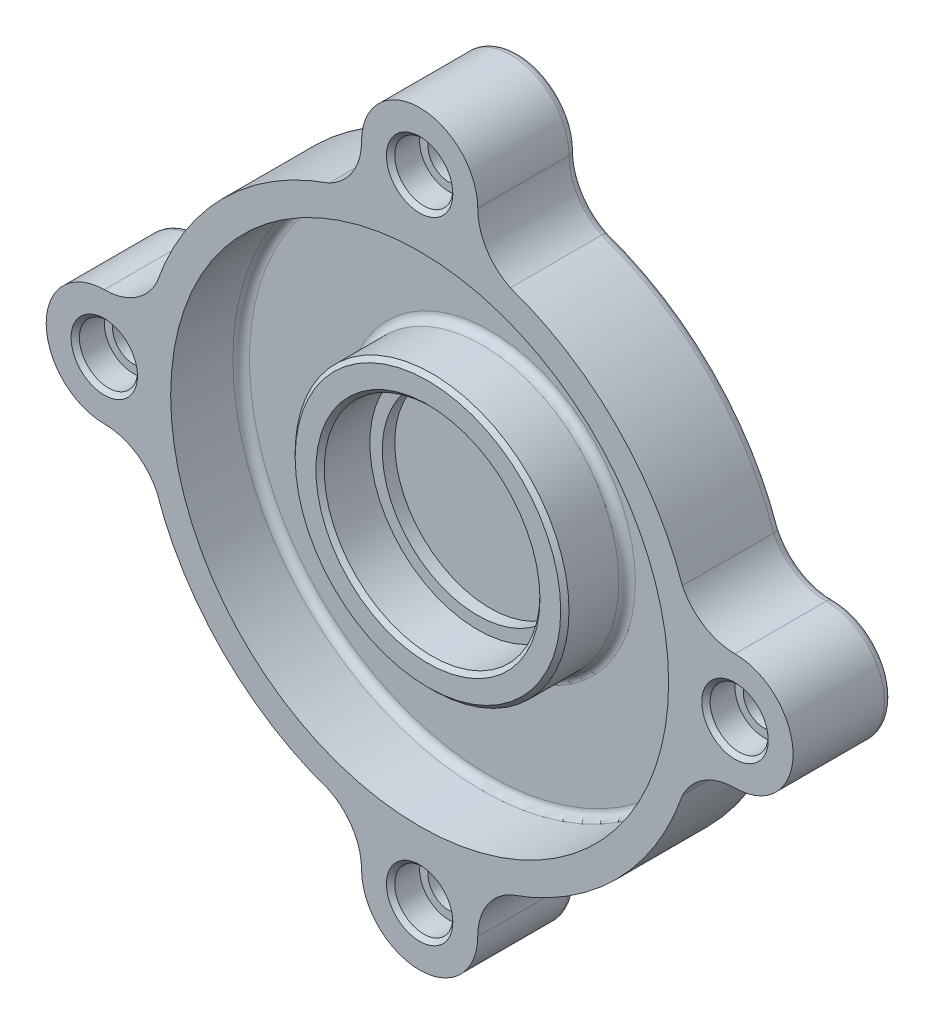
ISO-10303-21;
HEADER;
FILE_DESCRIPTION(('STEP AP214'),'2;1');
FILE_NAME('part.step','',(''),(''),'','','');
FILE_SCHEMA(('AUTOMOTIVE_DESIGN { 1 0 10303 214 1 1 1 1 }'));
ENDSEC;
DATA;
#1=APPLICATION_CONTEXT('core data for automotive mechanical design processes');
#2=APPLICATION_PROTOCOL_DEFINITION('international standard','automotive_design',2000,#1);
#3=PRODUCT_CONTEXT('',#1,'mechanical');
#4=PRODUCT('Part','Part','',(#3));
#5=PRODUCT_RELATED_PRODUCT_CATEGORY('part','',(#4));
#6=PRODUCT_DEFINITION_FORMATION('','',#4);
#7=PRODUCT_DEFINITION_CONTEXT('part definition',#1,'design');
#8=PRODUCT_DEFINITION('design','',#6,#7);
#9=PRODUCT_DEFINITION_SHAPE('','',#8);
#10=(LENGTH_UNIT() NAMED_UNIT(*) SI_UNIT(.MILLI.,.METRE.));
#11=(NAMED_UNIT(*) PLANE_ANGLE_UNIT() SI_UNIT($,.RADIAN.));
#12=(NAMED_UNIT(*) SI_UNIT($,.STERADIAN.) SOLID_ANGLE_UNIT());
#13=UNCERTAINTY_MEASURE_WITH_UNIT(LENGTH_MEASURE(1.E-05),#10,'distance_accuracy_value','');
#14=(GEOMETRIC_REPRESENTATION_CONTEXT(3) GLOBAL_UNCERTAINTY_ASSIGNED_CONTEXT((#13)) GLOBAL_UNIT_ASSIGNED_CONTEXT((#10,
#11,#12)) REPRESENTATION_CONTEXT('',''));
#15=CARTESIAN_POINT('',(0.,0.,0.));
#16=DIRECTION('',(0.,0.,1.));
#17=DIRECTION('',(1.,0.,0.));
#18=AXIS2_PLACEMENT_3D('',#15,#16,#17);
#19=CARTESIAN_POINT('',(-75.9999999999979,-2.15539625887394E-12,0.));
#20=DIRECTION('',(0.,0.,1.));
#21=DIRECTION('',(1.,0.,0.));
#22=AXIS2_PLACEMENT_3D('',#19,#20,#21);
#23=CYLINDRICAL_SURFACE('',#22,5.);
#24=CARTESIAN_POINT('',(-75.9999999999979,-2.15539625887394E-12,8.7320508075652));
#25=DIRECTION('',(0.,0.,-1.));
#26=DIRECTION('',(-1.,0.,0.));
#27=AXIS2_PLACEMENT_3D('',#24,#25,#26);
#28=CIRCLE('',#27,5.);
#29=CARTESIAN_POINT('',(-80.9999999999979,-2.15539625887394E-12,8.7320508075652));
#30=VERTEX_POINT('',#29);
#31=EDGE_CURVE('E1040',#30,#30,#28,.T.);
#32=ORIENTED_EDGE('',*,*,#31,.T.);
#33=EDGE_LOOP('',(#32));
#34=FACE_BOUND('',#33,.T.);
#35=CARTESIAN_POINT('',(-76.,7.96057745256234E-13,17.));
#36=DIRECTION('',(0.,0.,1.));
#37=DIRECTION('',(1.,0.,0.));
#38=AXIS2_PLACEMENT_3D('',#35,#36,#37);
#39=CIRCLE('',#38,5.);
#40=CARTESIAN_POINT('',(-71.,7.96057745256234E-13,17.));
#41=VERTEX_POINT('',#40);
#42=EDGE_CURVE('E941',#41,#41,#39,.T.);
#43=ORIENTED_EDGE('',*,*,#42,.T.);
#44=EDGE_LOOP('',(#43));
#45=FACE_BOUND('',#44,.T.);
#46=ADVANCED_FACE('F43',(#34,#45),#23,.F.);
#47=CARTESIAN_POINT('',(4.29217788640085E-12,-76.,0.));
#48=DIRECTION('',(0.,0.,1.));
#49=DIRECTION('',(1.,0.,0.));
#50=AXIS2_PLACEMENT_3D('',#47,#48,#49);
#51=CYLINDRICAL_SURFACE('',#50,5.);
#52=CARTESIAN_POINT('',(4.29217788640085E-12,-76.,8.7320508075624));
#53=DIRECTION('',(0.,0.,-1.));
#54=DIRECTION('',(-1.,0.,0.));
#55=AXIS2_PLACEMENT_3D('',#52,#53,#54);
#56=CIRCLE('',#55,5.);
#57=CARTESIAN_POINT('',(-4.99999999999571,-76.,8.7320508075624));
#58=VERTEX_POINT('',#57);
#59=EDGE_CURVE('E1032',#58,#58,#56,.T.);
#60=ORIENTED_EDGE('',*,*,#59,.T.);
#61=EDGE_LOOP('',(#60));
#62=FACE_BOUND('',#61,.T.);
#63=CARTESIAN_POINT('',(-5.30705163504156E-13,-76.,17.));
#64=DIRECTION('',(0.,0.,1.));
#65=DIRECTION('',(1.,0.,0.));
#66=AXIS2_PLACEMENT_3D('',#63,#64,#65);
#67=CIRCLE('',#66,5.);
#68=CARTESIAN_POINT('',(4.99999999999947,-76.,17.));
#69=VERTEX_POINT('',#68);
#70=EDGE_CURVE('E947',#69,#69,#67,.T.);
#71=ORIENTED_EDGE('',*,*,#70,.T.);
#72=EDGE_LOOP('',(#71));
#73=FACE_BOUND('',#72,.T.);
#74=ADVANCED_FACE('F746',(#62,#73),#51,.F.);
#75=CARTESIAN_POINT('',(76.0000000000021,2.14608894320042E-12,0.));
#76=DIRECTION('',(0.,0.,1.));
#77=DIRECTION('',(1.,0.,0.));
#78=AXIS2_PLACEMENT_3D('',#75,#76,#77);
#79=CYLINDRICAL_SURFACE('',#78,5.);
#80=CARTESIAN_POINT('',(76.0000000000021,2.14608894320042E-12,8.7320508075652));
#81=DIRECTION('',(0.,0.,-1.));
#82=DIRECTION('',(-1.,0.,0.));
#83=AXIS2_PLACEMENT_3D('',#80,#81,#82);
#84=CIRCLE('',#83,5.);
#85=CARTESIAN_POINT('',(71.0000000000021,2.14608894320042E-12,8.7320508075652));
#86=VERTEX_POINT('',#85);
#87=EDGE_CURVE('E53',#86,#86,#84,.T.);
#88=ORIENTED_EDGE('',*,*,#87,.T.);
#89=EDGE_LOOP('',(#88));
#90=FACE_BOUND('',#89,.T.);
#91=CARTESIAN_POINT('',(76.,-2.65352581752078E-13,17.));
#92=DIRECTION('',(0.,0.,1.));
#93=DIRECTION('',(1.,0.,0.));
#94=AXIS2_PLACEMENT_3D('',#91,#92,#93);
#95=CIRCLE('',#94,5.);
#96=CARTESIAN_POINT('',(81.,-2.65352581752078E-13,17.));
#97=VERTEX_POINT('',#96);
#98=EDGE_CURVE('E954',#97,#97,#95,.T.);
#99=ORIENTED_EDGE('',*,*,#98,.T.);
#100=EDGE_LOOP('',(#99));
#101=FACE_BOUND('',#100,.T.);
#102=ADVANCED_FACE('F752',(#90,#101),#79,.F.);
#103=CARTESIAN_POINT('',(0.,76.,0.));
#104=DIRECTION('',(0.,0.,1.));
#105=DIRECTION('',(1.,0.,0.));
#106=AXIS2_PLACEMENT_3D('',#103,#104,#105);
#107=CYLINDRICAL_SURFACE('',#106,5.);
#108=CARTESIAN_POINT('',(0.,76.,8.73205080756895));
#109=DIRECTION('',(0.,0.,-1.));
#110=DIRECTION('',(-1.,0.,0.));
#111=AXIS2_PLACEMENT_3D('',#108,#109,#110);
#112=CIRCLE('',#111,5.);
#113=CARTESIAN_POINT('',(-5.,76.,8.73205080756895));
#114=VERTEX_POINT('',#113);
#115=EDGE_CURVE('E1022',#114,#114,#112,.T.);
#116=ORIENTED_EDGE('',*,*,#115,.T.);
#117=EDGE_LOOP('',(#116));
#118=FACE_BOUND('',#117,.T.);
#119=CARTESIAN_POINT('',(0.,76.,17.));
#120=DIRECTION('',(0.,0.,1.));
#121=DIRECTION('',(1.,0.,0.));
#122=AXIS2_PLACEMENT_3D('',#119,#120,#121);
#123=CIRCLE('',#122,5.);
#124=CARTESIAN_POINT('',(5.,76.,17.));
#125=VERTEX_POINT('',#124);
#126=EDGE_CURVE('E240',#125,#125,#123,.T.);
#127=ORIENTED_EDGE('',*,*,#126,.T.);
#128=EDGE_LOOP('',(#127));
#129=FACE_BOUND('',#128,.T.);
#130=ADVANCED_FACE('F827',(#118,#129),#107,.F.);
#131=CARTESIAN_POINT('',(0.,0.,24.));
#132=DIRECTION('',(0.,0.,-1.));
#133=DIRECTION('',(-1.,0.,0.));
#134=AXIS2_PLACEMENT_3D('',#131,#132,#133);
#135=CYLINDRICAL_SURFACE('',#134,67.);
#136=DIRECTION('',(0.,0.,1.));
#137=VECTOR('',#136,1.);
#138=CARTESIAN_POINT('',(21.8792087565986,-63.3269312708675,0.));
#139=LINE('',#138,#137);
#140=CARTESIAN_POINT('',(21.8792087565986,-63.3269312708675,2.));
#141=VERTEX_POINT('',#140);
#142=CARTESIAN_POINT('',(21.8792087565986,-63.3269312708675,24.));
#143=VERTEX_POINT('',#142);
#144=EDGE_CURVE('E252',#141,#143,#139,.T.);
#145=ORIENTED_EDGE('',*,*,#144,.F.);
#146=CARTESIAN_POINT('',(0.,0.,2.));
#147=DIRECTION('',(0.,0.,1.));
#148=DIRECTION('',(1.,0.,0.));
#149=AXIS2_PLACEMENT_3D('',#146,#147,#148);
#150=CIRCLE('',#149,67.);
#151=CARTESIAN_POINT('',(63.3269312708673,-21.8792087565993,2.));
#152=VERTEX_POINT('',#151);
#153=EDGE_CURVE('E452',#141,#152,#150,.T.);
#154=ORIENTED_EDGE('',*,*,#153,.T.);
#155=DIRECTION('',(0.,0.,1.));
#156=VECTOR('',#155,1.);
#157=CARTESIAN_POINT('',(63.3269312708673,-21.8792087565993,0.));
#158=LINE('',#157,#156);
#159=CARTESIAN_POINT('',(63.3269312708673,-21.8792087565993,24.));
#160=VERTEX_POINT('',#159);
#161=EDGE_CURVE('E268',#152,#160,#158,.T.);
#162=ORIENTED_EDGE('',*,*,#161,.T.);
#163=CARTESIAN_POINT('',(0.,0.,24.));
#164=DIRECTION('',(0.,0.,1.));
#165=DIRECTION('',(1.,0.,0.));
#166=AXIS2_PLACEMENT_3D('',#163,#164,#165);
#167=CIRCLE('',#166,67.);
#168=EDGE_CURVE('E336',#143,#160,#167,.T.);
#169=ORIENTED_EDGE('',*,*,#168,.F.);
#170=EDGE_LOOP('',(#145,#154,#162,#169));
#171=FACE_BOUND('',#170,.T.);
#172=ADVANCED_FACE('F820',(#171),#135,.T.);
#173=DIRECTION('',(0.,0.,1.));
#174=VECTOR('',#173,1.);
#175=CARTESIAN_POINT('',(63.3269312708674,21.8792087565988,0.));
#176=LINE('',#175,#174);
#177=CARTESIAN_POINT('',(63.3269312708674,21.8792087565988,2.));
#178=VERTEX_POINT('',#177);
#179=CARTESIAN_POINT('',(63.3269312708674,21.8792087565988,24.));
#180=VERTEX_POINT('',#179);
#181=EDGE_CURVE('E269',#178,#180,#176,.T.);
#182=ORIENTED_EDGE('',*,*,#181,.F.);
#183=CARTESIAN_POINT('',(0.,0.,2.));
#184=DIRECTION('',(0.,0.,1.));
#185=DIRECTION('',(1.,0.,0.));
#186=AXIS2_PLACEMENT_3D('',#183,#184,#185);
#187=CIRCLE('',#186,67.);
#188=CARTESIAN_POINT('',(21.879208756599,63.3269312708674,2.));
#189=VERTEX_POINT('',#188);
#190=EDGE_CURVE('E431',#178,#189,#187,.T.);
#191=ORIENTED_EDGE('',*,*,#190,.T.);
#192=DIRECTION('',(0.,0.,1.));
#193=VECTOR('',#192,1.);
#194=CARTESIAN_POINT('',(21.879208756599,63.3269312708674,0.));
#195=LINE('',#194,#193);
#196=CARTESIAN_POINT('',(21.879208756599,63.3269312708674,24.));
#197=VERTEX_POINT('',#196);
#198=EDGE_CURVE('E300',#189,#197,#195,.T.);
#199=ORIENTED_EDGE('',*,*,#198,.T.);
#200=EDGE_CURVE('E858',#180,#197,#167,.T.);
#201=ORIENTED_EDGE('',*,*,#200,.F.);
#202=EDGE_LOOP('',(#182,#191,#199,#201));
#203=FACE_BOUND('',#202,.T.);
#204=ADVANCED_FACE('F824',(#203),#135,.T.);
#205=DIRECTION('',(0.,0.,1.));
#206=VECTOR('',#205,1.);
#207=CARTESIAN_POINT('',(-21.879208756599,63.3269312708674,0.));
#208=LINE('',#207,#206);
#209=CARTESIAN_POINT('',(-21.879208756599,63.3269312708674,2.));
#210=VERTEX_POINT('',#209);
#211=CARTESIAN_POINT('',(-21.879208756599,63.3269312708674,24.));
#212=VERTEX_POINT('',#211);
#213=EDGE_CURVE('E292',#210,#212,#208,.T.);
#214=ORIENTED_EDGE('',*,*,#213,.F.);
#215=CARTESIAN_POINT('',(0.,0.,2.));
#216=DIRECTION('',(0.,0.,1.));
#217=DIRECTION('',(1.,0.,0.));
#218=AXIS2_PLACEMENT_3D('',#215,#216,#217);
#219=CIRCLE('',#218,67.);
#220=CARTESIAN_POINT('',(-63.3269312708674,21.8792087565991,2.));
#221=VERTEX_POINT('',#220);
#222=EDGE_CURVE('E425',#210,#221,#219,.T.);
#223=ORIENTED_EDGE('',*,*,#222,.T.);
#224=DIRECTION('',(0.,0.,1.));
#225=VECTOR('',#224,1.);
#226=CARTESIAN_POINT('',(-63.3269312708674,21.8792087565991,0.));
#227=LINE('',#226,#225);
#228=CARTESIAN_POINT('',(-63.3269312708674,21.8792087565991,24.));
#229=VERTEX_POINT('',#228);
#230=EDGE_CURVE('E316',#221,#229,#227,.T.);
#231=ORIENTED_EDGE('',*,*,#230,.T.);
#232=EDGE_CURVE('E332',#212,#229,#167,.T.);
#233=ORIENTED_EDGE('',*,*,#232,.F.);
#234=EDGE_LOOP('',(#214,#223,#231,#233));
#235=FACE_BOUND('',#234,.T.);
#236=ADVANCED_FACE('F818',(#235),#135,.T.);
#237=DIRECTION('',(0.,0.,1.));
#238=VECTOR('',#237,1.);
#239=CARTESIAN_POINT('',(-63.3269312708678,-21.8792087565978,0.));
#240=LINE('',#239,#238);
#241=CARTESIAN_POINT('',(-63.3269312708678,-21.8792087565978,2.));
#242=VERTEX_POINT('',#241);
#243=CARTESIAN_POINT('',(-63.3269312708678,-21.8792087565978,24.));
#244=VERTEX_POINT('',#243);
#245=EDGE_CURVE('E317',#242,#244,#240,.T.);
#246=ORIENTED_EDGE('',*,*,#245,.F.);
#247=CARTESIAN_POINT('',(0.,0.,2.));
#248=DIRECTION('',(0.,0.,1.));
#249=DIRECTION('',(1.,0.,0.));
#250=AXIS2_PLACEMENT_3D('',#247,#248,#249);
#251=CIRCLE('',#250,67.);
#252=CARTESIAN_POINT('',(-21.8792087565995,-63.3269312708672,2.));
#253=VERTEX_POINT('',#252);
#254=EDGE_CURVE('E449',#242,#253,#251,.T.);
#255=ORIENTED_EDGE('',*,*,#254,.T.);
#256=DIRECTION('',(0.,0.,1.));
#257=VECTOR('',#256,1.);
#258=CARTESIAN_POINT('',(-21.8792087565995,-63.3269312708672,0.));
#259=LINE('',#258,#257);
#260=CARTESIAN_POINT('',(-21.8792087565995,-63.3269312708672,24.));
#261=VERTEX_POINT('',#260);
#262=EDGE_CURVE('E248',#253,#261,#259,.T.);
#263=ORIENTED_EDGE('',*,*,#262,.T.);
#264=EDGE_CURVE('E234',#244,#261,#167,.T.);
#265=ORIENTED_EDGE('',*,*,#264,.F.);
#266=EDGE_LOOP('',(#246,#255,#263,#265));
#267=FACE_BOUND('',#266,.T.);
#268=ADVANCED_FACE('F813',(#267),#135,.T.);
#269=CARTESIAN_POINT('',(0.,0.,24.));
#270=DIRECTION('',(0.,0.,1.));
#271=DIRECTION('',(1.,0.,0.));
#272=AXIS2_PLACEMENT_3D('',#269,#270,#271);
#273=PLANE('',#272);
#274=CARTESIAN_POINT('',(-76.,7.96057745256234E-13,24.));
#275=DIRECTION('',(0.,0.,1.));
#276=DIRECTION('',(1.,0.,0.));
#277=AXIS2_PLACEMENT_3D('',#274,#275,#276);
#278=CIRCLE('',#277,8.00000000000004);
#279=CARTESIAN_POINT('',(-67.9999999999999,7.96057745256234E-13,24.));
#280=VERTEX_POINT('',#279);
#281=EDGE_CURVE('E1082',#280,#280,#278,.F.);
#282=ORIENTED_EDGE('',*,*,#281,.T.);
#283=EDGE_LOOP('',(#282));
#284=FACE_BOUND('',#283,.T.);
#285=CARTESIAN_POINT('',(-5.30705163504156E-13,-76.,24.));
#286=DIRECTION('',(0.,0.,1.));
#287=DIRECTION('',(1.,0.,0.));
#288=AXIS2_PLACEMENT_3D('',#285,#286,#287);
#289=CIRCLE('',#288,8.00000000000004);
#290=CARTESIAN_POINT('',(7.9999999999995,-76.,24.));
#291=VERTEX_POINT('',#290);
#292=EDGE_CURVE('E1086',#291,#291,#289,.F.);
#293=ORIENTED_EDGE('',*,*,#292,.T.);
#294=EDGE_LOOP('',(#293));
#295=FACE_BOUND('',#294,.T.);
#296=CARTESIAN_POINT('',(76.,-2.65352581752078E-13,24.));
#297=DIRECTION('',(0.,0.,1.));
#298=DIRECTION('',(1.,0.,0.));
#299=AXIS2_PLACEMENT_3D('',#296,#297,#298);
#300=CIRCLE('',#299,8.00000000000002);
#301=CARTESIAN_POINT('',(84.,-2.65352581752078E-13,24.));
#302=VERTEX_POINT('',#301);
#303=EDGE_CURVE('E1090',#302,#302,#300,.F.);
#304=ORIENTED_EDGE('',*,*,#303,.T.);
#305=EDGE_LOOP('',(#304));
#306=FACE_BOUND('',#305,.T.);
#307=CARTESIAN_POINT('',(0.,76.,24.));
#308=DIRECTION('',(0.,0.,1.));
#309=DIRECTION('',(1.,0.,0.));
#310=AXIS2_PLACEMENT_3D('',#307,#308,#309);
#311=CIRCLE('',#310,8.00000000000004);
#312=CARTESIAN_POINT('',(8.00000000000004,76.,24.));
#313=VERTEX_POINT('',#312);
#314=EDGE_CURVE('E1094',#313,#313,#311,.F.);
#315=ORIENTED_EDGE('',*,*,#314,.T.);
#316=EDGE_LOOP('',(#315));
#317=FACE_BOUND('',#316,.T.);
#318=CARTESIAN_POINT('',(0.,0.,24.));
#319=DIRECTION('',(0.,0.,1.));
#320=DIRECTION('',(1.,0.,0.));
#321=AXIS2_PLACEMENT_3D('',#318,#319,#320);
#322=CIRCLE('',#321,60.);
#323=CARTESIAN_POINT('',(60.,0.,24.));
#324=VERTEX_POINT('',#323);
#325=EDGE_CURVE('E320',#324,#324,#322,.T.);
#326=ORIENTED_EDGE('',*,*,#325,.F.);
#327=EDGE_LOOP('',(#326));
#328=FACE_BOUND('',#327,.T.);
#329=ORIENTED_EDGE('',*,*,#264,.T.);
#330=CARTESIAN_POINT('',(-27.9997607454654,-75.9181521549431,24.));
#331=DIRECTION('',(0.,0.,1.));
#332=DIRECTION('',(1.,0.,0.));
#333=AXIS2_PLACEMENT_3D('',#330,#331,#332);
#334=CIRCLE('',#333,14.);
#335=CARTESIAN_POINT('',(-14.0000000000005,-75.999999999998,24.));
#336=VERTEX_POINT('',#335);
#337=EDGE_CURVE('E212',#261,#336,#334,.F.);
#338=ORIENTED_EDGE('',*,*,#337,.T.);
#339=CARTESIAN_POINT('',(-5.30705163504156E-13,-76.,24.));
#340=DIRECTION('',(0.,0.,1.));
#341=DIRECTION('',(1.,0.,0.));
#342=AXIS2_PLACEMENT_3D('',#339,#340,#341);
#343=CIRCLE('',#342,14.);
#344=CARTESIAN_POINT('',(13.9999999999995,-76.0000000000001,24.));
#345=VERTEX_POINT('',#344);
#346=EDGE_CURVE('E222',#336,#345,#343,.T.);
#347=ORIENTED_EDGE('',*,*,#346,.T.);
#348=CARTESIAN_POINT('',(27.9997607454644,-75.9181521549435,24.));
#349=DIRECTION('',(0.,0.,1.));
#350=DIRECTION('',(1.,0.,0.));
#351=AXIS2_PLACEMENT_3D('',#348,#349,#350);
#352=CIRCLE('',#351,14.);
#353=EDGE_CURVE('E219',#143,#345,#352,.T.);
#354=ORIENTED_EDGE('',*,*,#353,.F.);
#355=ORIENTED_EDGE('',*,*,#168,.T.);
#356=CARTESIAN_POINT('',(75.9181521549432,-27.9997607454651,24.));
#357=DIRECTION('',(0.,0.,1.));
#358=DIRECTION('',(1.,0.,0.));
#359=AXIS2_PLACEMENT_3D('',#356,#357,#358);
#360=CIRCLE('',#359,14.);
#361=CARTESIAN_POINT('',(75.9999999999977,-14.0000000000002,24.));
#362=VERTEX_POINT('',#361);
#363=EDGE_CURVE('E251',#160,#362,#360,.F.);
#364=ORIENTED_EDGE('',*,*,#363,.T.);
#365=CARTESIAN_POINT('',(76.,-2.65352581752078E-13,24.));
#366=DIRECTION('',(0.,0.,1.));
#367=DIRECTION('',(1.,0.,0.));
#368=AXIS2_PLACEMENT_3D('',#365,#366,#367);
#369=CIRCLE('',#368,14.);
#370=CARTESIAN_POINT('',(76.0000000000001,13.9999999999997,24.));
#371=VERTEX_POINT('',#370);
#372=EDGE_CURVE('E260',#362,#371,#369,.T.);
#373=ORIENTED_EDGE('',*,*,#372,.T.);
#374=CARTESIAN_POINT('',(75.9181521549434,27.9997607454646,24.));
#375=DIRECTION('',(0.,0.,1.));
#376=DIRECTION('',(1.,0.,0.));
#377=AXIS2_PLACEMENT_3D('',#374,#375,#376);
#378=CIRCLE('',#377,14.);
#379=EDGE_CURVE('E264',#180,#371,#378,.T.);
#380=ORIENTED_EDGE('',*,*,#379,.F.);
#381=ORIENTED_EDGE('',*,*,#200,.T.);
#382=CARTESIAN_POINT('',(27.9997607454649,75.9181521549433,24.));
#383=DIRECTION('',(0.,0.,1.));
#384=DIRECTION('',(1.,0.,0.));
#385=AXIS2_PLACEMENT_3D('',#382,#383,#384);
#386=CIRCLE('',#385,14.);
#387=CARTESIAN_POINT('',(14.,75.9999999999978,24.));
#388=VERTEX_POINT('',#387);
#389=EDGE_CURVE('E284',#197,#388,#386,.F.);
#390=ORIENTED_EDGE('',*,*,#389,.T.);
#391=CARTESIAN_POINT('',(0.,76.,24.));
#392=DIRECTION('',(0.,0.,1.));
#393=DIRECTION('',(1.,0.,0.));
#394=AXIS2_PLACEMENT_3D('',#391,#392,#393);
#395=CIRCLE('',#394,14.);
#396=CARTESIAN_POINT('',(-14.,75.9999999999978,24.));
#397=VERTEX_POINT('',#396);
#398=EDGE_CURVE('E288',#388,#397,#395,.T.);
#399=ORIENTED_EDGE('',*,*,#398,.T.);
#400=CARTESIAN_POINT('',(-27.9997607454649,75.9181521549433,24.));
#401=DIRECTION('',(0.,0.,1.));
#402=DIRECTION('',(1.,0.,0.));
#403=AXIS2_PLACEMENT_3D('',#400,#401,#402);
#404=CIRCLE('',#403,14.);
#405=EDGE_CURVE('E272',#212,#397,#404,.T.);
#406=ORIENTED_EDGE('',*,*,#405,.F.);
#407=ORIENTED_EDGE('',*,*,#232,.T.);
#408=CARTESIAN_POINT('',(-75.918152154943,27.9997607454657,24.));
#409=DIRECTION('',(0.,0.,1.));
#410=DIRECTION('',(1.,0.,0.));
#411=AXIS2_PLACEMENT_3D('',#408,#409,#410);
#412=CIRCLE('',#411,14.);
#413=CARTESIAN_POINT('',(-75.9999999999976,14.0000000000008,24.));
#414=VERTEX_POINT('',#413);
#415=EDGE_CURVE('E296',#229,#414,#412,.F.);
#416=ORIENTED_EDGE('',*,*,#415,.T.);
#417=CARTESIAN_POINT('',(-76.,7.8217995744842E-13,24.));
#418=DIRECTION('',(0.,0.,1.));
#419=DIRECTION('',(1.,0.,0.));
#420=AXIS2_PLACEMENT_3D('',#417,#418,#419);
#421=CIRCLE('',#420,14.);
#422=CARTESIAN_POINT('',(-76.0000000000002,-13.9999999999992,24.));
#423=VERTEX_POINT('',#422);
#424=EDGE_CURVE('E308',#414,#423,#421,.T.);
#425=ORIENTED_EDGE('',*,*,#424,.T.);
#426=CARTESIAN_POINT('',(-75.9181521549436,-27.9997607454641,24.));
#427=DIRECTION('',(0.,0.,1.));
#428=DIRECTION('',(1.,0.,0.));
#429=AXIS2_PLACEMENT_3D('',#426,#427,#428);
#430=CIRCLE('',#429,14.);
#431=EDGE_CURVE('E312',#244,#423,#430,.T.);
#432=ORIENTED_EDGE('',*,*,#431,.F.);
#433=EDGE_LOOP('',(#329,#338,#347,#354,#355,#364,#373,#380,#381,#390,#399,#406,#407,#416,#425,#432));
#434=FACE_BOUND('',#433,.T.);
#435=ADVANCED_FACE('F231',(#284,#295,#306,#317,#328,#434),#273,.T.);
#436=CARTESIAN_POINT('',(0.,0.,0.));
#437=DIRECTION('',(0.,0.,1.));
#438=DIRECTION('',(1.,0.,0.));
#439=AXIS2_PLACEMENT_3D('',#436,#437,#438);
#440=PLANE('',#439);
#441=CARTESIAN_POINT('',(0.,76.,0.));
#442=DIRECTION('',(0.,0.,1.));
#443=DIRECTION('',(1.,0.,0.));
#444=AXIS2_PLACEMENT_3D('',#441,#442,#443);
#445=CIRCLE('',#444,9.00000000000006);
#446=CARTESIAN_POINT('',(9.00000000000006,76.,0.));
#447=VERTEX_POINT('',#446);
#448=EDGE_CURVE('E1102',#447,#447,#445,.T.);
#449=ORIENTED_EDGE('',*,*,#448,.T.);
#450=EDGE_LOOP('',(#449));
#451=FACE_BOUND('',#450,.T.);
#452=CARTESIAN_POINT('',(-76.,-2.65352581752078E-13,0.));
#453=DIRECTION('',(0.,0.,1.));
#454=DIRECTION('',(1.,0.,0.));
#455=AXIS2_PLACEMENT_3D('',#452,#453,#454);
#456=CIRCLE('',#455,8.99999999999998);
#457=CARTESIAN_POINT('',(-67.,-2.65352581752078E-13,0.));
#458=VERTEX_POINT('',#457);
#459=EDGE_CURVE('E1106',#458,#458,#456,.T.);
#460=ORIENTED_EDGE('',*,*,#459,.T.);
#461=EDGE_LOOP('',(#460));
#462=FACE_BOUND('',#461,.T.);
#463=CARTESIAN_POINT('',(5.30705163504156E-13,-76.,0.));
#464=DIRECTION('',(0.,0.,1.));
#465=DIRECTION('',(1.,0.,0.));
#466=AXIS2_PLACEMENT_3D('',#463,#464,#465);
#467=CIRCLE('',#466,9.00000000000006);
#468=CARTESIAN_POINT('',(9.0000000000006,-76.,0.));
#469=VERTEX_POINT('',#468);
#470=EDGE_CURVE('E1110',#469,#469,#467,.T.);
#471=ORIENTED_EDGE('',*,*,#470,.T.);
#472=EDGE_LOOP('',(#471));
#473=FACE_BOUND('',#472,.T.);
#474=CARTESIAN_POINT('',(76.,7.96057745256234E-13,0.));
#475=DIRECTION('',(0.,0.,1.));
#476=DIRECTION('',(1.,0.,0.));
#477=AXIS2_PLACEMENT_3D('',#474,#475,#476);
#478=CIRCLE('',#477,9.00000000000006);
#479=CARTESIAN_POINT('',(85.,7.96057745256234E-13,0.));
#480=VERTEX_POINT('',#479);
#481=EDGE_CURVE('E1114',#480,#480,#478,.T.);
#482=ORIENTED_EDGE('',*,*,#481,.T.);
#483=EDGE_LOOP('',(#482));
#484=FACE_BOUND('',#483,.T.);
#485=CARTESIAN_POINT('',(-75.9181521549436,-27.9997607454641,0.));
#486=DIRECTION('',(0.,0.,1.));
#487=DIRECTION('',(1.,0.,0.));
#488=AXIS2_PLACEMENT_3D('',#485,#486,#487);
#489=CIRCLE('',#488,16.);
#490=CARTESIAN_POINT('',(-61.4740422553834,-21.1173418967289,0.));
#491=VERTEX_POINT('',#490);
#492=CARTESIAN_POINT('',(-76.0054265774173,-11.9999987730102,0.));
#493=VERTEX_POINT('',#492);
#494=EDGE_CURVE('E387',#491,#493,#489,.T.);
#495=ORIENTED_EDGE('',*,*,#494,.T.);
#496=CARTESIAN_POINT('',(-76.,7.8217995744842E-13,0.));
#497=DIRECTION('',(0.,0.,1.));
#498=DIRECTION('',(1.,0.,0.));
#499=AXIS2_PLACEMENT_3D('',#496,#497,#498);
#500=CIRCLE('',#499,12.);
#501=CARTESIAN_POINT('',(-76.0054265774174,11.9999987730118,0.));
#502=VERTEX_POINT('',#501);
#503=EDGE_CURVE('E390',#493,#502,#500,.F.);
#504=ORIENTED_EDGE('',*,*,#503,.T.);
#505=CARTESIAN_POINT('',(-75.918152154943,27.9997607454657,0.));
#506=DIRECTION('',(0.,0.,1.));
#507=DIRECTION('',(1.,0.,0.));
#508=AXIS2_PLACEMENT_3D('',#505,#506,#507);
#509=CIRCLE('',#508,16.);
#510=CARTESIAN_POINT('',(-61.4740422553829,21.1173418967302,0.));
#511=VERTEX_POINT('',#510);
#512=EDGE_CURVE('E381',#502,#511,#509,.T.);
#513=ORIENTED_EDGE('',*,*,#512,.T.);
#514=CARTESIAN_POINT('',(0.,0.,0.));
#515=DIRECTION('',(0.,0.,1.));
#516=DIRECTION('',(1.,0.,0.));
#517=AXIS2_PLACEMENT_3D('',#514,#515,#516);
#518=CIRCLE('',#517,65.);
#519=CARTESIAN_POINT('',(-21.1173418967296,61.4740422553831,0.));
#520=VERTEX_POINT('',#519);
#521=EDGE_CURVE('E378',#511,#520,#518,.F.);
#522=ORIENTED_EDGE('',*,*,#521,.T.);
#523=CARTESIAN_POINT('',(-27.9997607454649,75.9181521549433,0.));
#524=DIRECTION('',(0.,0.,1.));
#525=DIRECTION('',(1.,0.,0.));
#526=AXIS2_PLACEMENT_3D('',#523,#524,#525);
#527=CIRCLE('',#526,16.);
#528=CARTESIAN_POINT('',(-11.9999987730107,76.0054265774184,0.));
#529=VERTEX_POINT('',#528);
#530=EDGE_CURVE('E371',#520,#529,#527,.T.);
#531=ORIENTED_EDGE('',*,*,#530,.T.);
#532=CARTESIAN_POINT('',(0.,76.,0.));
#533=DIRECTION('',(0.,0.,1.));
#534=DIRECTION('',(1.,0.,0.));
#535=AXIS2_PLACEMENT_3D('',#532,#533,#534);
#536=CIRCLE('',#535,12.);
#537=CARTESIAN_POINT('',(11.999998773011,76.0054265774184,0.));
#538=VERTEX_POINT('',#537);
#539=EDGE_CURVE('E368',#529,#538,#536,.F.);
#540=ORIENTED_EDGE('',*,*,#539,.T.);
#541=CARTESIAN_POINT('',(27.9997607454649,75.9181521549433,0.));
#542=DIRECTION('',(0.,0.,1.));
#543=DIRECTION('',(1.,0.,0.));
#544=AXIS2_PLACEMENT_3D('',#541,#542,#543);
#545=CIRCLE('',#544,16.);
#546=CARTESIAN_POINT('',(21.1173418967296,61.4740422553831,0.));
#547=VERTEX_POINT('',#546);
#548=EDGE_CURVE('E365',#538,#547,#545,.T.);
#549=ORIENTED_EDGE('',*,*,#548,.T.);
#550=CARTESIAN_POINT('',(0.,0.,0.));
#551=DIRECTION('',(0.,0.,1.));
#552=DIRECTION('',(1.,0.,0.));
#553=AXIS2_PLACEMENT_3D('',#550,#551,#552);
#554=CIRCLE('',#553,65.);
#555=CARTESIAN_POINT('',(61.4740422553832,21.1173418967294,0.));
#556=VERTEX_POINT('',#555);
#557=EDGE_CURVE('E362',#547,#556,#554,.F.);
#558=ORIENTED_EDGE('',*,*,#557,.T.);
#559=CARTESIAN_POINT('',(75.9181521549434,27.9997607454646,0.));
#560=DIRECTION('',(0.,0.,1.));
#561=DIRECTION('',(1.,0.,0.));
#562=AXIS2_PLACEMENT_3D('',#559,#560,#561);
#563=CIRCLE('',#562,16.);
#564=CARTESIAN_POINT('',(76.0054265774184,11.9999987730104,0.));
#565=VERTEX_POINT('',#564);
#566=EDGE_CURVE('E356',#556,#565,#563,.T.);
#567=ORIENTED_EDGE('',*,*,#566,.T.);
#568=CARTESIAN_POINT('',(76.,-2.65352581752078E-13,0.));
#569=DIRECTION('',(0.,0.,1.));
#570=DIRECTION('',(1.,0.,0.));
#571=AXIS2_PLACEMENT_3D('',#568,#569,#570);
#572=CIRCLE('',#571,12.);
#573=CARTESIAN_POINT('',(76.0054265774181,-11.9999987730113,0.));
#574=VERTEX_POINT('',#573);
#575=EDGE_CURVE('E353',#565,#574,#572,.F.);
#576=ORIENTED_EDGE('',*,*,#575,.T.);
#577=CARTESIAN_POINT('',(75.9181521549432,-27.9997607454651,0.));
#578=DIRECTION('',(0.,0.,1.));
#579=DIRECTION('',(1.,0.,0.));
#580=AXIS2_PLACEMENT_3D('',#577,#578,#579);
#581=CIRCLE('',#580,16.);
#582=CARTESIAN_POINT('',(61.4740422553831,-21.1173418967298,0.));
#583=VERTEX_POINT('',#582);
#584=EDGE_CURVE('E350',#574,#583,#581,.T.);
#585=ORIENTED_EDGE('',*,*,#584,.T.);
#586=CARTESIAN_POINT('',(0.,0.,0.));
#587=DIRECTION('',(0.,0.,1.));
#588=DIRECTION('',(1.,0.,0.));
#589=AXIS2_PLACEMENT_3D('',#586,#587,#588);
#590=CIRCLE('',#589,65.);
#591=CARTESIAN_POINT('',(21.1173418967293,-61.4740422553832,0.));
#592=VERTEX_POINT('',#591);
#593=EDGE_CURVE('E344',#583,#592,#590,.F.);
#594=ORIENTED_EDGE('',*,*,#593,.T.);
#595=CARTESIAN_POINT('',(27.9997607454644,-75.9181521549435,0.));
#596=DIRECTION('',(0.,0.,1.));
#597=DIRECTION('',(1.,0.,0.));
#598=AXIS2_PLACEMENT_3D('',#595,#596,#597);
#599=CIRCLE('',#598,16.);
#600=CARTESIAN_POINT('',(11.9999987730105,-76.0054265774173,0.));
#601=VERTEX_POINT('',#600);
#602=EDGE_CURVE('E347',#592,#601,#599,.T.);
#603=ORIENTED_EDGE('',*,*,#602,.T.);
#604=CARTESIAN_POINT('',(-5.30705163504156E-13,-76.,0.));
#605=DIRECTION('',(0.,0.,1.));
#606=DIRECTION('',(1.,0.,0.));
#607=AXIS2_PLACEMENT_3D('',#604,#605,#606);
#608=CIRCLE('',#607,12.);
#609=CARTESIAN_POINT('',(-11.9999987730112,-76.0054265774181,0.));
#610=VERTEX_POINT('',#609);
#611=EDGE_CURVE('E359',#601,#610,#608,.F.);
#612=ORIENTED_EDGE('',*,*,#611,.T.);
#613=CARTESIAN_POINT('',(-27.9997607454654,-75.9181521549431,0.));
#614=DIRECTION('',(0.,0.,1.));
#615=DIRECTION('',(1.,0.,0.));
#616=AXIS2_PLACEMENT_3D('',#613,#614,#615);
#617=CIRCLE('',#616,16.);
#618=CARTESIAN_POINT('',(-21.1173418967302,-61.4740422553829,0.));
#619=VERTEX_POINT('',#618);
#620=EDGE_CURVE('E375',#610,#619,#617,.T.);
#621=ORIENTED_EDGE('',*,*,#620,.T.);
#622=CARTESIAN_POINT('',(0.,0.,0.));
#623=DIRECTION('',(0.,0.,1.));
#624=DIRECTION('',(1.,0.,0.));
#625=AXIS2_PLACEMENT_3D('',#622,#623,#624);
#626=CIRCLE('',#625,65.);
#627=EDGE_CURVE('E384',#619,#491,#626,.F.);
#628=ORIENTED_EDGE('',*,*,#627,.T.);
#629=EDGE_LOOP('',(#495,#504,#513,#522,#531,#540,#549,#558,#567,#576,#585,#594,#603,#612,#621,#628));
#630=FACE_BOUND('',#629,.T.);
#631=ADVANCED_FACE('F809',(#451,#462,#473,#484,#630),#440,.F.);
#632=CARTESIAN_POINT('',(0.,0.,7.));
#633=DIRECTION('',(0.,0.,1.));
#634=DIRECTION('',(1.,0.,0.));
#635=AXIS2_PLACEMENT_3D('',#632,#633,#634);
#636=CYLINDRICAL_SURFACE('',#635,60.);
#637=CARTESIAN_POINT('',(0.,0.,9.));
#638=DIRECTION('',(0.,0.,1.));
#639=DIRECTION('',(1.,0.,0.));
#640=AXIS2_PLACEMENT_3D('',#637,#638,#639);
#641=CIRCLE('',#640,60.);
#642=CARTESIAN_POINT('',(60.,0.,9.));
#643=VERTEX_POINT('',#642);
#644=EDGE_CURVE('E417',#643,#643,#641,.F.);
#645=ORIENTED_EDGE('',*,*,#644,.T.);
#646=EDGE_LOOP('',(#645));
#647=FACE_BOUND('',#646,.T.);
#648=ORIENTED_EDGE('',*,*,#325,.T.);
#649=EDGE_LOOP('',(#648));
#650=FACE_BOUND('',#649,.T.);
#651=ADVANCED_FACE('F805',(#647,#650),#636,.F.);
#652=CARTESIAN_POINT('',(0.,0.,7.));
#653=DIRECTION('',(0.,0.,1.));
#654=DIRECTION('',(1.,0.,0.));
#655=AXIS2_PLACEMENT_3D('',#652,#653,#654);
#656=PLANE('',#655);
#657=CARTESIAN_POINT('',(0.,0.,7.));
#658=DIRECTION('',(0.,0.,1.));
#659=DIRECTION('',(1.,0.,0.));
#660=AXIS2_PLACEMENT_3D('',#657,#658,#659);
#661=CIRCLE('',#660,58.);
#662=CARTESIAN_POINT('',(58.,0.,7.));
#663=VERTEX_POINT('',#662);
#664=EDGE_CURVE('E413',#663,#663,#661,.T.);
#665=ORIENTED_EDGE('',*,*,#664,.T.);
#666=EDGE_LOOP('',(#665));
#667=FACE_BOUND('',#666,.T.);
#668=CARTESIAN_POINT('',(0.,0.,7.));
#669=DIRECTION('',(0.,0.,1.));
#670=DIRECTION('',(1.,0.,0.));
#671=AXIS2_PLACEMENT_3D('',#668,#669,#670);
#672=CIRCLE('',#671,35.);
#673=CARTESIAN_POINT('',(35.,0.,7.));
#674=VERTEX_POINT('',#673);
#675=EDGE_CURVE('E409',#674,#674,#672,.F.);
#676=ORIENTED_EDGE('',*,*,#675,.T.);
#677=EDGE_LOOP('',(#676));
#678=FACE_BOUND('',#677,.T.);
#679=ADVANCED_FACE('F797',(#667,#678),#656,.T.);
#680=CARTESIAN_POINT('',(-75.9181521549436,-27.9997607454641,0.));
#681=DIRECTION('',(0.,0.,1.));
#682=DIRECTION('',(1.,0.,0.));
#683=AXIS2_PLACEMENT_3D('',#680,#681,#682);
#684=CYLINDRICAL_SURFACE('',#683,14.);
#685=DIRECTION('',(0.,0.,1.));
#686=VECTOR('',#685,1.);
#687=CARTESIAN_POINT('',(-76.0000000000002,-13.9999999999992,0.));
#688=LINE('',#687,#686);
#689=CARTESIAN_POINT('',(-76.0000000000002,-13.9999999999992,2.));
#690=VERTEX_POINT('',#689);
#691=EDGE_CURVE('E321',#690,#423,#688,.T.);
#692=ORIENTED_EDGE('',*,*,#691,.F.);
#693=CARTESIAN_POINT('',(-75.9181521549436,-27.9997607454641,2.));
#694=DIRECTION('',(0.,0.,1.));
#695=DIRECTION('',(1.,0.,0.));
#696=AXIS2_PLACEMENT_3D('',#693,#694,#695);
#697=CIRCLE('',#696,14.);
#698=EDGE_CURVE('E60',#690,#242,#697,.F.);
#699=ORIENTED_EDGE('',*,*,#698,.T.);
#700=ORIENTED_EDGE('',*,*,#245,.T.);
#701=ORIENTED_EDGE('',*,*,#431,.T.);
#702=EDGE_LOOP('',(#692,#699,#700,#701));
#703=FACE_BOUND('',#702,.T.);
#704=ADVANCED_FACE('F793',(#703),#684,.F.);
#705=CARTESIAN_POINT('',(-76.,7.8217995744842E-13,0.));
#706=DIRECTION('',(0.,0.,1.));
#707=DIRECTION('',(1.,0.,0.));
#708=AXIS2_PLACEMENT_3D('',#705,#706,#707);
#709=CYLINDRICAL_SURFACE('',#708,14.);
#710=DIRECTION('',(0.,0.,1.));
#711=VECTOR('',#710,1.);
#712=CARTESIAN_POINT('',(-75.9999999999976,14.0000000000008,0.));
#713=LINE('',#712,#711);
#714=CARTESIAN_POINT('',(-75.9999999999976,14.0000000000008,2.));
#715=VERTEX_POINT('',#714);
#716=EDGE_CURVE('E324',#715,#414,#713,.T.);
#717=ORIENTED_EDGE('',*,*,#716,.F.);
#718=CARTESIAN_POINT('',(-76.,7.8217995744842E-13,2.));
#719=DIRECTION('',(0.,0.,1.));
#720=DIRECTION('',(1.,0.,0.));
#721=AXIS2_PLACEMENT_3D('',#718,#719,#720);
#722=CIRCLE('',#721,14.);
#723=EDGE_CURVE('E68',#715,#690,#722,.T.);
#724=ORIENTED_EDGE('',*,*,#723,.T.);
#725=ORIENTED_EDGE('',*,*,#691,.T.);
#726=ORIENTED_EDGE('',*,*,#424,.F.);
#727=EDGE_LOOP('',(#717,#724,#725,#726));
#728=FACE_BOUND('',#727,.T.);
#729=ADVANCED_FACE('F796',(#728),#709,.T.);
#730=CARTESIAN_POINT('',(-75.918152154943,27.9997607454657,0.));
#731=DIRECTION('',(0.,0.,1.));
#732=DIRECTION('',(1.,0.,0.));
#733=AXIS2_PLACEMENT_3D('',#730,#731,#732);
#734=CYLINDRICAL_SURFACE('',#733,14.);
#735=ORIENTED_EDGE('',*,*,#230,.F.);
#736=CARTESIAN_POINT('',(-75.918152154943,27.9997607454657,2.));
#737=DIRECTION('',(0.,0.,1.));
#738=DIRECTION('',(1.,0.,0.));
#739=AXIS2_PLACEMENT_3D('',#736,#737,#738);
#740=CIRCLE('',#739,14.);
#741=EDGE_CURVE('E406',#221,#715,#740,.F.);
#742=ORIENTED_EDGE('',*,*,#741,.T.);
#743=ORIENTED_EDGE('',*,*,#716,.T.);
#744=ORIENTED_EDGE('',*,*,#415,.F.);
#745=EDGE_LOOP('',(#735,#742,#743,#744));
#746=FACE_BOUND('',#745,.T.);
#747=ADVANCED_FACE('F791',(#746),#734,.F.);
#748=CARTESIAN_POINT('',(-27.9997607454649,75.9181521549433,0.));
#749=DIRECTION('',(0.,0.,1.));
#750=DIRECTION('',(1.,0.,0.));
#751=AXIS2_PLACEMENT_3D('',#748,#749,#750);
#752=CYLINDRICAL_SURFACE('',#751,14.);
#753=DIRECTION('',(0.,0.,1.));
#754=VECTOR('',#753,1.);
#755=CARTESIAN_POINT('',(-14.,75.9999999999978,0.));
#756=LINE('',#755,#754);
#757=CARTESIAN_POINT('',(-14.,75.9999999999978,2.));
#758=VERTEX_POINT('',#757);
#759=EDGE_CURVE('E293',#758,#397,#756,.T.);
#760=ORIENTED_EDGE('',*,*,#759,.F.);
#761=CARTESIAN_POINT('',(-27.9997607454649,75.9181521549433,2.));
#762=DIRECTION('',(0.,0.,1.));
#763=DIRECTION('',(1.,0.,0.));
#764=AXIS2_PLACEMENT_3D('',#761,#762,#763);
#765=CIRCLE('',#764,14.);
#766=EDGE_CURVE('E393',#758,#210,#765,.F.);
#767=ORIENTED_EDGE('',*,*,#766,.T.);
#768=ORIENTED_EDGE('',*,*,#213,.T.);
#769=ORIENTED_EDGE('',*,*,#405,.T.);
#770=EDGE_LOOP('',(#760,#767,#768,#769));
#771=FACE_BOUND('',#770,.T.);
#772=ADVANCED_FACE('F784',(#771),#752,.F.);
#773=CARTESIAN_POINT('',(0.,76.,0.));
#774=DIRECTION('',(0.,0.,1.));
#775=DIRECTION('',(1.,0.,0.));
#776=AXIS2_PLACEMENT_3D('',#773,#774,#775);
#777=CYLINDRICAL_SURFACE('',#776,14.);
#778=DIRECTION('',(0.,0.,1.));
#779=VECTOR('',#778,1.);
#780=CARTESIAN_POINT('',(14.,75.9999999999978,0.));
#781=LINE('',#780,#779);
#782=CARTESIAN_POINT('',(14.,75.9999999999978,2.));
#783=VERTEX_POINT('',#782);
#784=EDGE_CURVE('E297',#783,#388,#781,.T.);
#785=ORIENTED_EDGE('',*,*,#784,.F.);
#786=CARTESIAN_POINT('',(0.,76.,2.));
#787=DIRECTION('',(0.,0.,1.));
#788=DIRECTION('',(1.,0.,0.));
#789=AXIS2_PLACEMENT_3D('',#786,#787,#788);
#790=CIRCLE('',#789,14.);
#791=EDGE_CURVE('E397',#783,#758,#790,.T.);
#792=ORIENTED_EDGE('',*,*,#791,.T.);
#793=ORIENTED_EDGE('',*,*,#759,.T.);
#794=ORIENTED_EDGE('',*,*,#398,.F.);
#795=EDGE_LOOP('',(#785,#792,#793,#794));
#796=FACE_BOUND('',#795,.T.);
#797=ADVANCED_FACE('F781',(#796),#777,.T.);
#798=CARTESIAN_POINT('',(27.9997607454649,75.9181521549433,0.));
#799=DIRECTION('',(0.,0.,1.));
#800=DIRECTION('',(1.,0.,0.));
#801=AXIS2_PLACEMENT_3D('',#798,#799,#800);
#802=CYLINDRICAL_SURFACE('',#801,14.);
#803=ORIENTED_EDGE('',*,*,#198,.F.);
#804=CARTESIAN_POINT('',(27.9997607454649,75.9181521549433,2.));
#805=DIRECTION('',(0.,0.,1.));
#806=DIRECTION('',(1.,0.,0.));
#807=AXIS2_PLACEMENT_3D('',#804,#805,#806);
#808=CIRCLE('',#807,14.);
#809=EDGE_CURVE('E428',#189,#783,#808,.F.);
#810=ORIENTED_EDGE('',*,*,#809,.T.);
#811=ORIENTED_EDGE('',*,*,#784,.T.);
#812=ORIENTED_EDGE('',*,*,#389,.F.);
#813=EDGE_LOOP('',(#803,#810,#811,#812));
#814=FACE_BOUND('',#813,.T.);
#815=ADVANCED_FACE('F773',(#814),#802,.F.);
#816=CARTESIAN_POINT('',(75.9181521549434,27.9997607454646,0.));
#817=DIRECTION('',(0.,0.,1.));
#818=DIRECTION('',(1.,0.,0.));
#819=AXIS2_PLACEMENT_3D('',#816,#817,#818);
#820=CYLINDRICAL_SURFACE('',#819,14.);
#821=DIRECTION('',(0.,0.,1.));
#822=VECTOR('',#821,1.);
#823=CARTESIAN_POINT('',(76.0000000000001,13.9999999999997,0.));
#824=LINE('',#823,#822);
#825=CARTESIAN_POINT('',(76.0000000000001,13.9999999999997,2.));
#826=VERTEX_POINT('',#825);
#827=EDGE_CURVE('E273',#826,#371,#824,.T.);
#828=ORIENTED_EDGE('',*,*,#827,.F.);
#829=CARTESIAN_POINT('',(75.9181521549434,27.9997607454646,2.));
#830=DIRECTION('',(0.,0.,1.));
#831=DIRECTION('',(1.,0.,0.));
#832=AXIS2_PLACEMENT_3D('',#829,#830,#831);
#833=CIRCLE('',#832,14.);
#834=EDGE_CURVE('E400',#826,#178,#833,.F.);
#835=ORIENTED_EDGE('',*,*,#834,.T.);
#836=ORIENTED_EDGE('',*,*,#181,.T.);
#837=ORIENTED_EDGE('',*,*,#379,.T.);
#838=EDGE_LOOP('',(#828,#835,#836,#837));
#839=FACE_BOUND('',#838,.T.);
#840=ADVANCED_FACE('F769',(#839),#820,.F.);
#841=CARTESIAN_POINT('',(76.,-2.65352581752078E-13,0.));
#842=DIRECTION('',(0.,0.,1.));
#843=DIRECTION('',(1.,0.,0.));
#844=AXIS2_PLACEMENT_3D('',#841,#842,#843);
#845=CYLINDRICAL_SURFACE('',#844,14.);
#846=DIRECTION('',(0.,0.,1.));
#847=VECTOR('',#846,1.);
#848=CARTESIAN_POINT('',(75.9999999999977,-14.0000000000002,0.));
#849=LINE('',#848,#847);
#850=CARTESIAN_POINT('',(75.9999999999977,-14.0000000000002,2.));
#851=VERTEX_POINT('',#850);
#852=EDGE_CURVE('E276',#851,#362,#849,.T.);
#853=ORIENTED_EDGE('',*,*,#852,.F.);
#854=CARTESIAN_POINT('',(76.,-2.65352581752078E-13,2.));
#855=DIRECTION('',(0.,0.,1.));
#856=DIRECTION('',(1.,0.,0.));
#857=AXIS2_PLACEMENT_3D('',#854,#855,#856);
#858=CIRCLE('',#857,14.);
#859=EDGE_CURVE('E403',#851,#826,#858,.T.);
#860=ORIENTED_EDGE('',*,*,#859,.T.);
#861=ORIENTED_EDGE('',*,*,#827,.T.);
#862=ORIENTED_EDGE('',*,*,#372,.F.);
#863=EDGE_LOOP('',(#853,#860,#861,#862));
#864=FACE_BOUND('',#863,.T.);
#865=ADVANCED_FACE('F772',(#864),#845,.T.);
#866=CARTESIAN_POINT('',(75.9181521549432,-27.9997607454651,0.));
#867=DIRECTION('',(0.,0.,1.));
#868=DIRECTION('',(1.,0.,0.));
#869=AXIS2_PLACEMENT_3D('',#866,#867,#868);
#870=CYLINDRICAL_SURFACE('',#869,14.);
#871=ORIENTED_EDGE('',*,*,#161,.F.);
#872=CARTESIAN_POINT('',(75.9181521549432,-27.9997607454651,2.));
#873=DIRECTION('',(0.,0.,1.));
#874=DIRECTION('',(1.,0.,0.));
#875=AXIS2_PLACEMENT_3D('',#872,#873,#874);
#876=CIRCLE('',#875,14.);
#877=EDGE_CURVE('E434',#152,#851,#876,.F.);
#878=ORIENTED_EDGE('',*,*,#877,.T.);
#879=ORIENTED_EDGE('',*,*,#852,.T.);
#880=ORIENTED_EDGE('',*,*,#363,.F.);
#881=EDGE_LOOP('',(#871,#878,#879,#880));
#882=FACE_BOUND('',#881,.T.);
#883=ADVANCED_FACE('F768',(#882),#870,.F.);
#884=CARTESIAN_POINT('',(-27.9997607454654,-75.9181521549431,0.));
#885=DIRECTION('',(0.,0.,1.));
#886=DIRECTION('',(1.,0.,0.));
#887=AXIS2_PLACEMENT_3D('',#884,#885,#886);
#888=CYLINDRICAL_SURFACE('',#887,14.);
#889=ORIENTED_EDGE('',*,*,#262,.F.);
#890=CARTESIAN_POINT('',(-27.9997607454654,-75.9181521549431,2.));
#891=DIRECTION('',(0.,0.,1.));
#892=DIRECTION('',(1.,0.,0.));
#893=AXIS2_PLACEMENT_3D('',#890,#891,#892);
#894=CIRCLE('',#893,14.);
#895=CARTESIAN_POINT('',(-14.0000000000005,-75.999999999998,2.));
#896=VERTEX_POINT('',#895);
#897=EDGE_CURVE('E214',#253,#896,#894,.F.);
#898=ORIENTED_EDGE('',*,*,#897,.T.);
#899=DIRECTION('',(0.,0.,1.));
#900=VECTOR('',#899,1.);
#901=CARTESIAN_POINT('',(-14.0000000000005,-75.999999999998,0.));
#902=LINE('',#901,#900);
#903=EDGE_CURVE('E207',#896,#336,#902,.T.);
#904=ORIENTED_EDGE('',*,*,#903,.T.);
#905=ORIENTED_EDGE('',*,*,#337,.F.);
#906=EDGE_LOOP('',(#889,#898,#904,#905));
#907=FACE_BOUND('',#906,.T.);
#908=ADVANCED_FACE('F210',(#907),#888,.F.);
#909=CARTESIAN_POINT('',(27.9997607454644,-75.9181521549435,0.));
#910=DIRECTION('',(0.,0.,1.));
#911=DIRECTION('',(1.,0.,0.));
#912=AXIS2_PLACEMENT_3D('',#909,#910,#911);
#913=CYLINDRICAL_SURFACE('',#912,14.);
#914=DIRECTION('',(0.,0.,1.));
#915=VECTOR('',#914,1.);
#916=CARTESIAN_POINT('',(13.9999999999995,-76.0000000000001,0.));
#917=LINE('',#916,#915);
#918=CARTESIAN_POINT('',(13.9999999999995,-76.0000000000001,2.));
#919=VERTEX_POINT('',#918);
#920=EDGE_CURVE('E218',#919,#345,#917,.T.);
#921=ORIENTED_EDGE('',*,*,#920,.F.);
#922=CARTESIAN_POINT('',(27.9997607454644,-75.9181521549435,2.));
#923=DIRECTION('',(0.,0.,1.));
#924=DIRECTION('',(1.,0.,0.));
#925=AXIS2_PLACEMENT_3D('',#922,#923,#924);
#926=CIRCLE('',#925,14.);
#927=EDGE_CURVE('E437',#919,#141,#926,.F.);
#928=ORIENTED_EDGE('',*,*,#927,.T.);
#929=ORIENTED_EDGE('',*,*,#144,.T.);
#930=ORIENTED_EDGE('',*,*,#353,.T.);
#931=EDGE_LOOP('',(#921,#928,#929,#930));
#932=FACE_BOUND('',#931,.T.);
#933=ADVANCED_FACE('F759',(#932),#913,.F.);
#934=CARTESIAN_POINT('',(-5.30705163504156E-13,-76.,0.));
#935=DIRECTION('',(0.,0.,1.));
#936=DIRECTION('',(1.,0.,0.));
#937=AXIS2_PLACEMENT_3D('',#934,#935,#936);
#938=CYLINDRICAL_SURFACE('',#937,14.);
#939=ORIENTED_EDGE('',*,*,#903,.F.);
#940=CARTESIAN_POINT('',(-5.30705163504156E-13,-76.,2.));
#941=DIRECTION('',(0.,0.,1.));
#942=DIRECTION('',(1.,0.,0.));
#943=AXIS2_PLACEMENT_3D('',#940,#941,#942);
#944=CIRCLE('',#943,14.);
#945=EDGE_CURVE('E440',#896,#919,#944,.T.);
#946=ORIENTED_EDGE('',*,*,#945,.T.);
#947=ORIENTED_EDGE('',*,*,#920,.T.);
#948=ORIENTED_EDGE('',*,*,#346,.F.);
#949=EDGE_LOOP('',(#939,#946,#947,#948));
#950=FACE_BOUND('',#949,.T.);
#951=ADVANCED_FACE('F223',(#950),#938,.T.);
#952=CARTESIAN_POINT('',(0.,76.,17.));
#953=DIRECTION('',(0.,0.,1.));
#954=DIRECTION('',(1.,0.,0.));
#955=AXIS2_PLACEMENT_3D('',#952,#953,#954);
#956=CYLINDRICAL_SURFACE('',#955,7.);
#957=CARTESIAN_POINT('',(0.,76.,23.));
#958=DIRECTION('',(0.,0.,1.));
#959=DIRECTION('',(1.,0.,0.));
#960=AXIS2_PLACEMENT_3D('',#957,#958,#959);
#961=CIRCLE('',#960,7.);
#962=CARTESIAN_POINT('',(7.,76.,23.));
#963=VERTEX_POINT('',#962);
#964=EDGE_CURVE('E1071',#963,#963,#961,.T.);
#965=ORIENTED_EDGE('',*,*,#964,.T.);
#966=EDGE_LOOP('',(#965));
#967=FACE_BOUND('',#966,.T.);
#968=CARTESIAN_POINT('',(0.,76.,17.));
#969=DIRECTION('',(0.,0.,1.));
#970=DIRECTION('',(1.,0.,0.));
#971=AXIS2_PLACEMENT_3D('',#968,#969,#970);
#972=CIRCLE('',#971,7.);
#973=CARTESIAN_POINT('',(7.,76.,17.));
#974=VERTEX_POINT('',#973);
#975=EDGE_CURVE('E236',#974,#974,#972,.T.);
#976=ORIENTED_EDGE('',*,*,#975,.F.);
#977=EDGE_LOOP('',(#976));
#978=FACE_BOUND('',#977,.T.);
#979=ADVANCED_FACE('F765',(#967,#978),#956,.F.);
#980=CARTESIAN_POINT('',(0.,76.,17.));
#981=DIRECTION('',(0.,0.,1.));
#982=DIRECTION('',(1.,0.,0.));
#983=AXIS2_PLACEMENT_3D('',#980,#981,#982);
#984=PLANE('',#983);
#985=ORIENTED_EDGE('',*,*,#126,.F.);
#986=EDGE_LOOP('',(#985));
#987=FACE_BOUND('',#986,.T.);
#988=ORIENTED_EDGE('',*,*,#975,.T.);
#989=EDGE_LOOP('',(#988));
#990=FACE_BOUND('',#989,.T.);
#991=ADVANCED_FACE('F968',(#987,#990),#984,.T.);
#992=CARTESIAN_POINT('',(76.,-2.65352581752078E-13,17.));
#993=DIRECTION('',(0.,0.,1.));
#994=DIRECTION('',(1.,0.,0.));
#995=AXIS2_PLACEMENT_3D('',#992,#993,#994);
#996=CYLINDRICAL_SURFACE('',#995,7.);
#997=CARTESIAN_POINT('',(76.,-2.65352581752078E-13,23.));
#998=DIRECTION('',(0.,0.,1.));
#999=DIRECTION('',(1.,0.,0.));
#1000=AXIS2_PLACEMENT_3D('',#997,#998,#999);
#1001=CIRCLE('',#1000,7.);
#1002=CARTESIAN_POINT('',(83.,-2.65352581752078E-13,23.));
#1003=VERTEX_POINT('',#1002);
#1004=EDGE_CURVE('E1074',#1003,#1003,#1001,.T.);
#1005=ORIENTED_EDGE('',*,*,#1004,.T.);
#1006=EDGE_LOOP('',(#1005));
#1007=FACE_BOUND('',#1006,.T.);
#1008=CARTESIAN_POINT('',(76.,-2.65352581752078E-13,17.));
#1009=DIRECTION('',(0.,0.,1.));
#1010=DIRECTION('',(1.,0.,0.));
#1011=AXIS2_PLACEMENT_3D('',#1008,#1009,#1010);
#1012=CIRCLE('',#1011,7.);
#1013=CARTESIAN_POINT('',(83.,-2.65352581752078E-13,17.));
#1014=VERTEX_POINT('',#1013);
#1015=EDGE_CURVE('E958',#1014,#1014,#1012,.T.);
#1016=ORIENTED_EDGE('',*,*,#1015,.F.);
#1017=EDGE_LOOP('',(#1016));
#1018=FACE_BOUND('',#1017,.T.);
#1019=ADVANCED_FACE('F971',(#1007,#1018),#996,.F.);
#1020=CARTESIAN_POINT('',(76.,-2.65352581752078E-13,17.));
#1021=DIRECTION('',(0.,0.,1.));
#1022=DIRECTION('',(1.,0.,0.));
#1023=AXIS2_PLACEMENT_3D('',#1020,#1021,#1022);
#1024=PLANE('',#1023);
#1025=ORIENTED_EDGE('',*,*,#98,.F.);
#1026=EDGE_LOOP('',(#1025));
#1027=FACE_BOUND('',#1026,.T.);
#1028=ORIENTED_EDGE('',*,*,#1015,.T.);
#1029=EDGE_LOOP('',(#1028));
#1030=FACE_BOUND('',#1029,.T.);
#1031=ADVANCED_FACE('F983',(#1027,#1030),#1024,.T.);
#1032=CARTESIAN_POINT('',(-5.30705163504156E-13,-76.,17.));
#1033=DIRECTION('',(0.,0.,1.));
#1034=DIRECTION('',(1.,0.,0.));
#1035=AXIS2_PLACEMENT_3D('',#1032,#1033,#1034);
#1036=CYLINDRICAL_SURFACE('',#1035,7.);
#1037=CARTESIAN_POINT('',(-5.30705163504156E-13,-76.,23.));
#1038=DIRECTION('',(0.,0.,1.));
#1039=DIRECTION('',(1.,0.,0.));
#1040=AXIS2_PLACEMENT_3D('',#1037,#1038,#1039);
#1041=CIRCLE('',#1040,7.);
#1042=CARTESIAN_POINT('',(6.99999999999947,-76.,23.));
#1043=VERTEX_POINT('',#1042);
#1044=EDGE_CURVE('E1078',#1043,#1043,#1041,.T.);
#1045=ORIENTED_EDGE('',*,*,#1044,.T.);
#1046=EDGE_LOOP('',(#1045));
#1047=FACE_BOUND('',#1046,.T.);
#1048=CARTESIAN_POINT('',(-5.30705163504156E-13,-76.,17.));
#1049=DIRECTION('',(0.,0.,1.));
#1050=DIRECTION('',(1.,0.,0.));
#1051=AXIS2_PLACEMENT_3D('',#1048,#1049,#1050);
#1052=CIRCLE('',#1051,7.);
#1053=CARTESIAN_POINT('',(6.99999999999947,-76.,17.));
#1054=VERTEX_POINT('',#1053);
#1055=EDGE_CURVE('E950',#1054,#1054,#1052,.T.);
#1056=ORIENTED_EDGE('',*,*,#1055,.F.);
#1057=EDGE_LOOP('',(#1056));
#1058=FACE_BOUND('',#1057,.T.);
#1059=ADVANCED_FACE('F986',(#1047,#1058),#1036,.F.);
#1060=CARTESIAN_POINT('',(-5.30705163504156E-13,-76.,17.));
#1061=DIRECTION('',(0.,0.,1.));
#1062=DIRECTION('',(1.,0.,0.));
#1063=AXIS2_PLACEMENT_3D('',#1060,#1061,#1062);
#1064=PLANE('',#1063);
#1065=ORIENTED_EDGE('',*,*,#70,.F.);
#1066=EDGE_LOOP('',(#1065));
#1067=FACE_BOUND('',#1066,.T.);
#1068=ORIENTED_EDGE('',*,*,#1055,.T.);
#1069=EDGE_LOOP('',(#1068));
#1070=FACE_BOUND('',#1069,.T.);
#1071=ADVANCED_FACE('F991',(#1067,#1070),#1064,.T.);
#1072=CARTESIAN_POINT('',(-76.,7.96057745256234E-13,17.));
#1073=DIRECTION('',(0.,0.,1.));
#1074=DIRECTION('',(1.,0.,0.));
#1075=AXIS2_PLACEMENT_3D('',#1072,#1073,#1074);
#1076=CYLINDRICAL_SURFACE('',#1075,7.);
#1077=CARTESIAN_POINT('',(-76.,7.96057745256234E-13,23.));
#1078=DIRECTION('',(0.,0.,1.));
#1079=DIRECTION('',(1.,0.,0.));
#1080=AXIS2_PLACEMENT_3D('',#1077,#1078,#1079);
#1081=CIRCLE('',#1080,7.);
#1082=CARTESIAN_POINT('',(-69.,7.96057745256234E-13,23.));
#1083=VERTEX_POINT('',#1082);
#1084=EDGE_CURVE('E1098',#1083,#1083,#1081,.T.);
#1085=ORIENTED_EDGE('',*,*,#1084,.T.);
#1086=EDGE_LOOP('',(#1085));
#1087=FACE_BOUND('',#1086,.T.);
#1088=CARTESIAN_POINT('',(-76.,7.96057745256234E-13,17.));
#1089=DIRECTION('',(0.,0.,1.));
#1090=DIRECTION('',(1.,0.,0.));
#1091=AXIS2_PLACEMENT_3D('',#1088,#1089,#1090);
#1092=CIRCLE('',#1091,7.);
#1093=CARTESIAN_POINT('',(-69.,7.96057745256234E-13,17.));
#1094=VERTEX_POINT('',#1093);
#1095=EDGE_CURVE('E243',#1094,#1094,#1092,.T.);
#1096=ORIENTED_EDGE('',*,*,#1095,.F.);
#1097=EDGE_LOOP('',(#1096));
#1098=FACE_BOUND('',#1097,.T.);
#1099=ADVANCED_FACE('F994',(#1087,#1098),#1076,.F.);
#1100=CARTESIAN_POINT('',(-76.,7.96057745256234E-13,17.));
#1101=DIRECTION('',(0.,0.,1.));
#1102=DIRECTION('',(1.,0.,0.));
#1103=AXIS2_PLACEMENT_3D('',#1100,#1101,#1102);
#1104=PLANE('',#1103);
#1105=ORIENTED_EDGE('',*,*,#42,.F.);
#1106=EDGE_LOOP('',(#1105));
#1107=FACE_BOUND('',#1106,.T.);
#1108=ORIENTED_EDGE('',*,*,#1095,.T.);
#1109=EDGE_LOOP('',(#1108));
#1110=FACE_BOUND('',#1109,.T.);
#1111=ADVANCED_FACE('F999',(#1107,#1110),#1104,.T.);
#1112=CARTESIAN_POINT('',(76.,7.96057745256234E-13,7.));
#1113=DIRECTION('',(0.,0.,-1.));
#1114=DIRECTION('',(-1.,0.,0.));
#1115=AXIS2_PLACEMENT_3D('',#1112,#1113,#1114);
#1116=CYLINDRICAL_SURFACE('',#1115,8.00000000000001);
#1117=CARTESIAN_POINT('',(76.,7.96057745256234E-13,1.00000000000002));
#1118=DIRECTION('',(0.,0.,1.));
#1119=DIRECTION('',(1.,0.,0.));
#1120=AXIS2_PLACEMENT_3D('',#1117,#1118,#1119);
#1121=CIRCLE('',#1120,8.00000000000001);
#1122=CARTESIAN_POINT('',(84.,7.96057745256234E-13,1.00000000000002));
#1123=VERTEX_POINT('',#1122);
#1124=EDGE_CURVE('E1059',#1123,#1123,#1121,.F.);
#1125=ORIENTED_EDGE('',*,*,#1124,.T.);
#1126=EDGE_LOOP('',(#1125));
#1127=FACE_BOUND('',#1126,.T.);
#1128=CARTESIAN_POINT('',(76.,7.96057745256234E-13,7.));
#1129=DIRECTION('',(0.,0.,-1.));
#1130=DIRECTION('',(-1.,0.,0.));
#1131=AXIS2_PLACEMENT_3D('',#1128,#1129,#1130);
#1132=CIRCLE('',#1131,8.00000000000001);
#1133=CARTESIAN_POINT('',(68.,7.96057745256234E-13,7.));
#1134=VERTEX_POINT('',#1133);
#1135=EDGE_CURVE('E925',#1134,#1134,#1132,.T.);
#1136=ORIENTED_EDGE('',*,*,#1135,.F.);
#1137=EDGE_LOOP('',(#1136));
#1138=FACE_BOUND('',#1137,.T.);
#1139=ADVANCED_FACE('F1002',(#1127,#1138),#1116,.F.);
#1140=CARTESIAN_POINT('',(76.,7.96057745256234E-13,7.));
#1141=DIRECTION('',(0.,0.,-1.));
#1142=DIRECTION('',(-1.,0.,0.));
#1143=AXIS2_PLACEMENT_3D('',#1140,#1141,#1142);
#1144=PLANE('',#1143);
#1145=CARTESIAN_POINT('',(76.0000000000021,2.14608894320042E-12,7.));
#1146=DIRECTION('',(0.,0.,-1.));
#1147=DIRECTION('',(-1.,0.,0.));
#1148=AXIS2_PLACEMENT_3D('',#1145,#1146,#1147);
#1149=CIRCLE('',#1148,5.9999999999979);
#1150=CARTESIAN_POINT('',(70.0000000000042,2.14608894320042E-12,7.));
#1151=VERTEX_POINT('',#1150);
#1152=EDGE_CURVE('E11',#1151,#1151,#1149,.F.);
#1153=ORIENTED_EDGE('',*,*,#1152,.T.);
#1154=EDGE_LOOP('',(#1153));
#1155=FACE_BOUND('',#1154,.T.);
#1156=ORIENTED_EDGE('',*,*,#1135,.T.);
#1157=EDGE_LOOP('',(#1156));
#1158=FACE_BOUND('',#1157,.T.);
#1159=ADVANCED_FACE('F1156',(#1155,#1158),#1144,.T.);
#1160=CARTESIAN_POINT('',(5.30705163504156E-13,-76.,7.));
#1161=DIRECTION('',(0.,0.,-1.));
#1162=DIRECTION('',(-1.,0.,0.));
#1163=AXIS2_PLACEMENT_3D('',#1160,#1161,#1162);
#1164=CYLINDRICAL_SURFACE('',#1163,8.);
#1165=CARTESIAN_POINT('',(5.30705163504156E-13,-76.,1.00000000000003));
#1166=DIRECTION('',(0.,0.,1.));
#1167=DIRECTION('',(1.,0.,0.));
#1168=AXIS2_PLACEMENT_3D('',#1165,#1166,#1167);
#1169=CIRCLE('',#1168,8.);
#1170=CARTESIAN_POINT('',(8.00000000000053,-76.,1.00000000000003));
#1171=VERTEX_POINT('',#1170);
#1172=EDGE_CURVE('E1063',#1171,#1171,#1169,.F.);
#1173=ORIENTED_EDGE('',*,*,#1172,.T.);
#1174=EDGE_LOOP('',(#1173));
#1175=FACE_BOUND('',#1174,.T.);
#1176=CARTESIAN_POINT('',(5.30705163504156E-13,-76.,7.));
#1177=DIRECTION('',(0.,0.,-1.));
#1178=DIRECTION('',(-1.,0.,0.));
#1179=AXIS2_PLACEMENT_3D('',#1176,#1177,#1178);
#1180=CIRCLE('',#1179,8.);
#1181=CARTESIAN_POINT('',(-7.99999999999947,-76.,7.));
#1182=VERTEX_POINT('',#1181);
#1183=EDGE_CURVE('E929',#1182,#1182,#1180,.T.);
#1184=ORIENTED_EDGE('',*,*,#1183,.F.);
#1185=EDGE_LOOP('',(#1184));
#1186=FACE_BOUND('',#1185,.T.);
#1187=ADVANCED_FACE('F1152',(#1175,#1186),#1164,.F.);
#1188=CARTESIAN_POINT('',(5.30705163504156E-13,-76.,7.));
#1189=DIRECTION('',(0.,0.,-1.));
#1190=DIRECTION('',(-1.,0.,0.));
#1191=AXIS2_PLACEMENT_3D('',#1188,#1189,#1190);
#1192=PLANE('',#1191);
#1193=CARTESIAN_POINT('',(4.29217788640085E-12,-76.,7.));
#1194=DIRECTION('',(0.,0.,-1.));
#1195=DIRECTION('',(-1.,0.,0.));
#1196=AXIS2_PLACEMENT_3D('',#1193,#1194,#1195);
#1197=CIRCLE('',#1196,5.99999999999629);
#1198=CARTESIAN_POINT('',(-5.99999999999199,-76.,7.));
#1199=VERTEX_POINT('',#1198);
#1200=EDGE_CURVE('E1028',#1199,#1199,#1197,.F.);
#1201=ORIENTED_EDGE('',*,*,#1200,.T.);
#1202=EDGE_LOOP('',(#1201));
#1203=FACE_BOUND('',#1202,.T.);
#1204=ORIENTED_EDGE('',*,*,#1183,.T.);
#1205=EDGE_LOOP('',(#1204));
#1206=FACE_BOUND('',#1205,.T.);
#1207=ADVANCED_FACE('F1148',(#1203,#1206),#1192,.T.);
#1208=CARTESIAN_POINT('',(-76.,-2.65352581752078E-13,7.));
#1209=DIRECTION('',(0.,0.,-1.));
#1210=DIRECTION('',(-1.,0.,0.));
#1211=AXIS2_PLACEMENT_3D('',#1208,#1209,#1210);
#1212=CYLINDRICAL_SURFACE('',#1211,8.);
#1213=CARTESIAN_POINT('',(-76.,-2.65352581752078E-13,0.999999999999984));
#1214=DIRECTION('',(0.,0.,1.));
#1215=DIRECTION('',(1.,0.,0.));
#1216=AXIS2_PLACEMENT_3D('',#1213,#1214,#1215);
#1217=CIRCLE('',#1216,8.);
#1218=CARTESIAN_POINT('',(-68.,-2.65352581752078E-13,0.999999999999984));
#1219=VERTEX_POINT('',#1218);
#1220=EDGE_CURVE('E1067',#1219,#1219,#1217,.F.);
#1221=ORIENTED_EDGE('',*,*,#1220,.T.);
#1222=EDGE_LOOP('',(#1221));
#1223=FACE_BOUND('',#1222,.T.);
#1224=CARTESIAN_POINT('',(-76.,-2.65352581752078E-13,7.));
#1225=DIRECTION('',(0.,0.,-1.));
#1226=DIRECTION('',(-1.,0.,0.));
#1227=AXIS2_PLACEMENT_3D('',#1224,#1225,#1226);
#1228=CIRCLE('',#1227,8.);
#1229=CARTESIAN_POINT('',(-84.,-2.65352581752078E-13,7.));
#1230=VERTEX_POINT('',#1229);
#1231=EDGE_CURVE('E933',#1230,#1230,#1228,.T.);
#1232=ORIENTED_EDGE('',*,*,#1231,.F.);
#1233=EDGE_LOOP('',(#1232));
#1234=FACE_BOUND('',#1233,.T.);
#1235=ADVANCED_FACE('F1144',(#1223,#1234),#1212,.F.);
#1236=CARTESIAN_POINT('',(-76.,-2.65352581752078E-13,7.));
#1237=DIRECTION('',(0.,0.,-1.));
#1238=DIRECTION('',(-1.,0.,0.));
#1239=AXIS2_PLACEMENT_3D('',#1236,#1237,#1238);
#1240=PLANE('',#1239);
#1241=CARTESIAN_POINT('',(-75.9999999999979,-2.15539625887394E-12,7.));
#1242=DIRECTION('',(0.,0.,-1.));
#1243=DIRECTION('',(-1.,0.,0.));
#1244=AXIS2_PLACEMENT_3D('',#1241,#1242,#1243);
#1245=CIRCLE('',#1244,5.9999999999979);
#1246=CARTESIAN_POINT('',(-81.9999999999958,-2.15539625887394E-12,7.));
#1247=VERTEX_POINT('',#1246);
#1248=EDGE_CURVE('E1036',#1247,#1247,#1245,.F.);
#1249=ORIENTED_EDGE('',*,*,#1248,.T.);
#1250=EDGE_LOOP('',(#1249));
#1251=FACE_BOUND('',#1250,.T.);
#1252=ORIENTED_EDGE('',*,*,#1231,.T.);
#1253=EDGE_LOOP('',(#1252));
#1254=FACE_BOUND('',#1253,.T.);
#1255=ADVANCED_FACE('F1126',(#1251,#1254),#1240,.T.);
#1256=CARTESIAN_POINT('',(0.,76.,7.));
#1257=DIRECTION('',(0.,0.,-1.));
#1258=DIRECTION('',(-1.,0.,0.));
#1259=AXIS2_PLACEMENT_3D('',#1256,#1257,#1258);
#1260=CYLINDRICAL_SURFACE('',#1259,8.);
#1261=CARTESIAN_POINT('',(0.,76.,1.00000000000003));
#1262=DIRECTION('',(0.,0.,1.));
#1263=DIRECTION('',(1.,0.,0.));
#1264=AXIS2_PLACEMENT_3D('',#1261,#1262,#1263);
#1265=CIRCLE('',#1264,8.);
#1266=CARTESIAN_POINT('',(8.,76.,1.00000000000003));
#1267=VERTEX_POINT('',#1266);
#1268=EDGE_CURVE('E455',#1267,#1267,#1265,.F.);
#1269=ORIENTED_EDGE('',*,*,#1268,.T.);
#1270=EDGE_LOOP('',(#1269));
#1271=FACE_BOUND('',#1270,.T.);
#1272=CARTESIAN_POINT('',(0.,76.,7.));
#1273=DIRECTION('',(0.,0.,-1.));
#1274=DIRECTION('',(-1.,0.,0.));
#1275=AXIS2_PLACEMENT_3D('',#1272,#1273,#1274);
#1276=CIRCLE('',#1275,8.);
#1277=CARTESIAN_POINT('',(-8.,76.,7.));
#1278=VERTEX_POINT('',#1277);
#1279=EDGE_CURVE('E937',#1278,#1278,#1276,.T.);
#1280=ORIENTED_EDGE('',*,*,#1279,.F.);
#1281=EDGE_LOOP('',(#1280));
#1282=FACE_BOUND('',#1281,.T.);
#1283=ADVANCED_FACE('F1121',(#1271,#1282),#1260,.F.);
#1284=CARTESIAN_POINT('',(0.,76.,7.));
#1285=DIRECTION('',(0.,0.,-1.));
#1286=DIRECTION('',(-1.,0.,0.));
#1287=AXIS2_PLACEMENT_3D('',#1284,#1285,#1286);
#1288=PLANE('',#1287);
#1289=CARTESIAN_POINT('',(0.,76.,7.));
#1290=DIRECTION('',(0.,0.,-1.));
#1291=DIRECTION('',(-1.,0.,0.));
#1292=AXIS2_PLACEMENT_3D('',#1289,#1290,#1291);
#1293=CIRCLE('',#1292,6.00000000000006);
#1294=CARTESIAN_POINT('',(-6.00000000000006,76.,7.));
#1295=VERTEX_POINT('',#1294);
#1296=EDGE_CURVE('E1019',#1295,#1295,#1293,.F.);
#1297=ORIENTED_EDGE('',*,*,#1296,.T.);
#1298=EDGE_LOOP('',(#1297));
#1299=FACE_BOUND('',#1298,.T.);
#1300=ORIENTED_EDGE('',*,*,#1279,.T.);
#1301=EDGE_LOOP('',(#1300));
#1302=FACE_BOUND('',#1301,.T.);
#1303=ADVANCED_FACE('F1125',(#1299,#1302),#1288,.T.);
#1304=CARTESIAN_POINT('',(0.,0.,22.));
#1305=DIRECTION('',(0.,0.,1.));
#1306=DIRECTION('',(1.,0.,0.));
#1307=AXIS2_PLACEMENT_3D('',#1304,#1305,#1306);
#1308=PLANE('',#1307);
#1309=CARTESIAN_POINT('',(0.,0.,22.));
#1310=DIRECTION('',(0.,0.,1.));
#1311=DIRECTION('',(1.,0.,0.));
#1312=AXIS2_PLACEMENT_3D('',#1309,#1310,#1311);
#1313=CIRCLE('',#1312,32.0000000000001);
#1314=CARTESIAN_POINT('',(32.0000000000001,0.,22.));
#1315=VERTEX_POINT('',#1314);
#1316=EDGE_CURVE('E1051',#1315,#1315,#1313,.T.);
#1317=ORIENTED_EDGE('',*,*,#1316,.T.);
#1318=EDGE_LOOP('',(#1317));
#1319=FACE_BOUND('',#1318,.T.);
#1320=CARTESIAN_POINT('',(0.,0.,22.));
#1321=DIRECTION('',(0.,0.,1.));
#1322=DIRECTION('',(1.,0.,0.));
#1323=AXIS2_PLACEMENT_3D('',#1320,#1321,#1322);
#1324=CIRCLE('',#1323,27.);
#1325=CARTESIAN_POINT('',(27.,0.,22.));
#1326=VERTEX_POINT('',#1325);
#1327=EDGE_CURVE('E1055',#1326,#1326,#1324,.F.);
#1328=ORIENTED_EDGE('',*,*,#1327,.T.);
#1329=EDGE_LOOP('',(#1328));
#1330=FACE_BOUND('',#1329,.T.);
#1331=ADVANCED_FACE('F1131',(#1319,#1330),#1308,.T.);
#1332=CARTESIAN_POINT('',(0.,0.,22.));
#1333=DIRECTION('',(0.,0.,-1.));
#1334=DIRECTION('',(-1.,0.,0.));
#1335=AXIS2_PLACEMENT_3D('',#1332,#1333,#1334);
#1336=CYLINDRICAL_SURFACE('',#1335,33.);
#1337=CARTESIAN_POINT('',(0.,0.,21.));
#1338=DIRECTION('',(0.,0.,1.));
#1339=DIRECTION('',(1.,0.,0.));
#1340=AXIS2_PLACEMENT_3D('',#1337,#1338,#1339);
#1341=CIRCLE('',#1340,33.);
#1342=CARTESIAN_POINT('',(33.,0.,21.));
#1343=VERTEX_POINT('',#1342);
#1344=EDGE_CURVE('E1047',#1343,#1343,#1341,.F.);
#1345=ORIENTED_EDGE('',*,*,#1344,.T.);
#1346=EDGE_LOOP('',(#1345));
#1347=FACE_BOUND('',#1346,.T.);
#1348=CARTESIAN_POINT('',(0.,0.,9.));
#1349=DIRECTION('',(0.,0.,1.));
#1350=DIRECTION('',(1.,0.,0.));
#1351=AXIS2_PLACEMENT_3D('',#1348,#1349,#1350);
#1352=CIRCLE('',#1351,33.);
#1353=CARTESIAN_POINT('',(33.,0.,9.));
#1354=VERTEX_POINT('',#1353);
#1355=EDGE_CURVE('E421',#1354,#1354,#1352,.T.);
#1356=ORIENTED_EDGE('',*,*,#1355,.T.);
#1357=EDGE_LOOP('',(#1356));
#1358=FACE_BOUND('',#1357,.T.);
#1359=ADVANCED_FACE('F1137',(#1347,#1358),#1336,.T.);
#1360=CARTESIAN_POINT('',(0.,0.,22.));
#1361=DIRECTION('',(0.,0.,-1.));
#1362=DIRECTION('',(-1.,0.,0.));
#1363=AXIS2_PLACEMENT_3D('',#1360,#1361,#1362);
#1364=CYLINDRICAL_SURFACE('',#1363,26.);
#1365=CARTESIAN_POINT('',(0.,0.,21.));
#1366=DIRECTION('',(0.,0.,1.));
#1367=DIRECTION('',(1.,0.,0.));
#1368=AXIS2_PLACEMENT_3D('',#1365,#1366,#1367);
#1369=CIRCLE('',#1368,26.);
#1370=CARTESIAN_POINT('',(26.,0.,21.));
#1371=VERTEX_POINT('',#1370);
#1372=EDGE_CURVE('E1043',#1371,#1371,#1369,.T.);
#1373=ORIENTED_EDGE('',*,*,#1372,.T.);
#1374=EDGE_LOOP('',(#1373));
#1375=FACE_BOUND('',#1374,.T.);
#1376=CARTESIAN_POINT('',(0.,0.,10.));
#1377=DIRECTION('',(0.,0.,1.));
#1378=DIRECTION('',(1.,0.,0.));
#1379=AXIS2_PLACEMENT_3D('',#1376,#1377,#1378);
#1380=CIRCLE('',#1379,26.);
#1381=CARTESIAN_POINT('',(26.,0.,10.));
#1382=VERTEX_POINT('',#1381);
#1383=EDGE_CURVE('E340',#1382,#1382,#1380,.T.);
#1384=ORIENTED_EDGE('',*,*,#1383,.F.);
#1385=EDGE_LOOP('',(#1384));
#1386=FACE_BOUND('',#1385,.T.);
#1387=ADVANCED_FACE('F1213',(#1375,#1386),#1364,.F.);
#1388=CARTESIAN_POINT('',(0.,0.,10.));
#1389=DIRECTION('',(0.,0.,1.));
#1390=DIRECTION('',(1.,0.,0.));
#1391=AXIS2_PLACEMENT_3D('',#1388,#1389,#1390);
#1392=PLANE('',#1391);
#1393=ORIENTED_EDGE('',*,*,#1383,.T.);
#1394=EDGE_LOOP('',(#1393));
#1395=FACE_BOUND('',#1394,.T.);
#1396=CARTESIAN_POINT('',(0.,0.,10.));
#1397=DIRECTION('',(0.,0.,1.));
#1398=DIRECTION('',(1.,0.,0.));
#1399=AXIS2_PLACEMENT_3D('',#1396,#1397,#1398);
#1400=CIRCLE('',#1399,23.);
#1401=CARTESIAN_POINT('',(23.,0.,10.));
#1402=VERTEX_POINT('',#1401);
#1403=EDGE_CURVE('E922',#1402,#1402,#1400,.T.);
#1404=ORIENTED_EDGE('',*,*,#1403,.F.);
#1405=EDGE_LOOP('',(#1404));
#1406=FACE_BOUND('',#1405,.T.);
#1407=ADVANCED_FACE('F1222',(#1395,#1406),#1392,.T.);
#1408=CARTESIAN_POINT('',(0.,0.,10.));
#1409=DIRECTION('',(0.,0.,-1.));
#1410=DIRECTION('',(-1.,0.,0.));
#1411=AXIS2_PLACEMENT_3D('',#1408,#1409,#1410);
#1412=CYLINDRICAL_SURFACE('',#1411,23.);
#1413=ORIENTED_EDGE('',*,*,#1403,.T.);
#1414=EDGE_LOOP('',(#1413));
#1415=FACE_BOUND('',#1414,.T.);
#1416=CARTESIAN_POINT('',(0.,0.,7.));
#1417=DIRECTION('',(0.,0.,1.));
#1418=DIRECTION('',(1.,0.,0.));
#1419=AXIS2_PLACEMENT_3D('',#1416,#1417,#1418);
#1420=CIRCLE('',#1419,23.);
#1421=CARTESIAN_POINT('',(23.,0.,7.));
#1422=VERTEX_POINT('',#1421);
#1423=EDGE_CURVE('E335',#1422,#1422,#1420,.F.);
#1424=ORIENTED_EDGE('',*,*,#1423,.T.);
#1425=EDGE_LOOP('',(#1424));
#1426=FACE_BOUND('',#1425,.T.);
#1427=ADVANCED_FACE('F1547',(#1415,#1426),#1412,.F.);
#1428=ORIENTED_EDGE('',*,*,#1423,.F.);
#1429=EDGE_LOOP('',(#1428));
#1430=FACE_BOUND('',#1429,.T.);
#1431=ADVANCED_FACE('F639',(#1430),#656,.T.);
#1432=CARTESIAN_POINT('',(27.9997607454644,-75.9181521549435,2.));
#1433=DIRECTION('',(0.,0.,1.));
#1434=DIRECTION('',(1.,0.,0.));
#1435=AXIS2_PLACEMENT_3D('',#1432,#1433,#1434);
#1436=TOROIDAL_SURFACE('',#1435,16.,2.);
#1437=CARTESIAN_POINT('',(21.8792087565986,-63.3269312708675,2.));
#1438=CARTESIAN_POINT('',(21.8792087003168,-63.3269309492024,1.94380452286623));
#1439=CARTESIAN_POINT('',(21.8783004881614,-63.3247376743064,1.88763599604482));
#1440=CARTESIAN_POINT('',(21.8746778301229,-63.3159879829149,1.77570143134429));
#1441=CARTESIAN_POINT('',(21.8719634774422,-63.3094317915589,1.71993537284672));
#1442=CARTESIAN_POINT('',(21.8611379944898,-63.2832811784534,1.5539361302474));
#1443=CARTESIAN_POINT('',(21.8503443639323,-63.257204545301,1.44481588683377));
#1444=CARTESIAN_POINT('',(21.8219176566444,-63.1884929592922,1.23286757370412));
#1445=CARTESIAN_POINT('',(21.8042814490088,-63.1458504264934,1.13004240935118));
#1446=CARTESIAN_POINT('',(21.7626939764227,-63.0452275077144,0.933597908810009));
#1447=CARTESIAN_POINT('',(21.7387440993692,-62.9872504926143,0.839976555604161));
#1448=CARTESIAN_POINT('',(21.6852110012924,-62.8575517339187,0.664507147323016));
#1449=CARTESIAN_POINT('',(21.655623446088,-62.7858194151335,0.58266823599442));
#1450=CARTESIAN_POINT('',(21.5916778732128,-62.6306418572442,0.433124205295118));
#1451=CARTESIAN_POINT('',(21.557318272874,-62.5471927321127,0.365423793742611));
#1452=CARTESIAN_POINT('',(21.4847663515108,-62.3708035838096,0.24597974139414));
#1453=CARTESIAN_POINT('',(21.4465667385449,-62.2778454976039,0.194267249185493));
#1454=CARTESIAN_POINT('',(21.3675007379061,-62.0852300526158,0.108461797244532));
#1455=CARTESIAN_POINT('',(21.3266366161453,-61.9855783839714,0.0743540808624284));
#1456=CARTESIAN_POINT('',(21.2591391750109,-61.820797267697,0.0340328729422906));
#1457=CARTESIAN_POINT('',(21.2329466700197,-61.7568110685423,0.0221512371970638));
#1458=CARTESIAN_POINT('',(21.1802909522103,-61.6280902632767,0.00569147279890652));
#1459=CARTESIAN_POINT('',(21.153828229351,-61.5633569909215,0.00110189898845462));
#1460=CARTESIAN_POINT('',(21.1240338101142,-61.4904250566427,5.84014170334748E-05));
#1461=CARTESIAN_POINT('',(21.1206875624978,-61.4822332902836,-1.53862984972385E-07));
#1462=CARTESIAN_POINT('',(21.1173418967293,-61.4740422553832,0.));
#1463=B_SPLINE_CURVE_WITH_KNOTS('',3,(#1437,#1438,#1439,#1440,#1441,#1442,#1443,#1444,#1445,
#1446,#1447,#1448,#1449,#1450,#1451,#1452,#1453,#1454,#1455,#1456,#1457,#1458,#1459,#1460,#1461,
#1462),.UNSPECIFIED.,.F.,.F.,(4,2,2,2,2,2,2,2,2,2,2,2,4),(0.,0.168482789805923,
0.336956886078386,0.673354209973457,1.00990563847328,1.34638314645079,1.68312038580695,
2.01996957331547,2.35747095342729,2.69468897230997,2.90481953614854,3.1146199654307,
3.14116622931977),.UNSPECIFIED.);
#1464=EDGE_CURVE('E621',#141,#592,#1463,.T.);
#1465=ORIENTED_EDGE('',*,*,#1464,.F.);
#1466=ORIENTED_EDGE('',*,*,#927,.F.);
#1467=CARTESIAN_POINT('',(13.9999999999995,-76.0000000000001,2.));
#1468=CARTESIAN_POINT('',(13.9999996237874,-75.9999999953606,1.94373292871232));
#1469=CARTESIAN_POINT('',(13.9976240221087,-76.0000069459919,1.88749281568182));
#1470=CARTESIAN_POINT('',(13.9881467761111,-76.0000346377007,1.77541499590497));
#1471=CARTESIAN_POINT('',(13.9810453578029,-76.0000553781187,1.71957727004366));
#1472=CARTESIAN_POINT('',(13.9527183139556,-76.0001380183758,1.55335636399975));
#1473=CARTESIAN_POINT('',(13.9244697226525,-76.0002203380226,1.44408668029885));
#1474=CARTESIAN_POINT('',(13.8500289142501,-76.0004361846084,1.23184383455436));
#1475=CARTESIAN_POINT('',(13.8038280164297,-76.00056973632,1.12887374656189));
#1476=CARTESIAN_POINT('',(13.6948036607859,-76.000882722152,0.932163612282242));
#1477=CARTESIAN_POINT('',(13.6319845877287,-76.0010621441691,0.838421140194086));
#1478=CARTESIAN_POINT('',(13.4915105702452,-76.0014599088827,0.662823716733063));
#1479=CARTESIAN_POINT('',(13.4138569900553,-76.0016782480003,0.580967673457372));
#1480=CARTESIAN_POINT('',(13.2458694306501,-76.0021457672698,0.431415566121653));
#1481=CARTESIAN_POINT('',(13.1555297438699,-76.0023949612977,0.363725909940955));
#1482=CARTESIAN_POINT('',(12.9647381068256,-76.0029151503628,0.244451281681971));
#1483=CARTESIAN_POINT('',(12.8642813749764,-76.0031861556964,0.192873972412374));
#1484=CARTESIAN_POINT('',(12.6562125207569,-76.003740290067,0.107383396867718));
#1485=CARTESIAN_POINT('',(12.5486105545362,-76.0040234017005,0.0734456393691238));
#1486=CARTESIAN_POINT('',(12.3859579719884,-76.0044455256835,0.0368367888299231));
#1487=CARTESIAN_POINT('',(12.3324115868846,-76.0045835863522,0.0270663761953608));
#1488=CARTESIAN_POINT('',(12.2247425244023,-76.0048593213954,0.0119265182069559));
#1489=CARTESIAN_POINT('',(12.1706205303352,-76.004996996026,0.00655234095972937));
#1490=CARTESIAN_POINT('',(12.0776225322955,-76.0052319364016,0.00112865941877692));
#1491=CARTESIAN_POINT('',(12.0388068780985,-76.0053295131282,-3.21637650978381E-06));
#1492=CARTESIAN_POINT('',(11.9999987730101,-76.0054265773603,0.));
#1493=B_SPLINE_CURVE_WITH_KNOTS('',3,(#1467,#1468,#1469,#1470,#1471,#1472,#1473,#1474,#1475,
#1476,#1477,#1478,#1479,#1480,#1481,#1482,#1483,#1484,#1485,#1486,#1487,#1488,#1489,#1490,#1491,
#1492),.UNSPECIFIED.,.F.,.F.,(4,2,2,2,2,2,2,2,2,2,2,2,4),(0.,0.16869753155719,0.337386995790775,
0.674236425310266,1.01124893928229,1.34817261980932,1.68506533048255,2.02211009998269,
2.35931492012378,2.6960502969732,2.85919697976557,3.02216782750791,3.13859403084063),.UNSPECIFIED.);
#1494=EDGE_CURVE('E629',#601,#919,#1493,.F.);
#1495=ORIENTED_EDGE('',*,*,#1494,.F.);
#1496=ORIENTED_EDGE('',*,*,#602,.F.);
#1497=EDGE_LOOP('',(#1465,#1466,#1495,#1496));
#1498=FACE_BOUND('',#1497,.T.);
#1499=ADVANCED_FACE('F635',(#1498),#1436,.T.);
#1500=CARTESIAN_POINT('',(-5.30705163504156E-13,-76.,2.));
#1501=DIRECTION('',(0.,0.,1.));
#1502=DIRECTION('',(1.,0.,0.));
#1503=AXIS2_PLACEMENT_3D('',#1500,#1501,#1502);
#1504=TOROIDAL_SURFACE('',#1503,12.,2.);
#1505=ORIENTED_EDGE('',*,*,#1494,.T.);
#1506=ORIENTED_EDGE('',*,*,#945,.F.);
#1507=CARTESIAN_POINT('',(-14.0000000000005,-75.999999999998,2.));
#1508=CARTESIAN_POINT('',(-13.9999996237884,-75.9999999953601,1.94373292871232));
#1509=CARTESIAN_POINT('',(-13.9976240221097,-76.0000069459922,1.88749281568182));
#1510=CARTESIAN_POINT('',(-13.9881467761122,-76.0000346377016,1.77541499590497));
#1511=CARTESIAN_POINT('',(-13.9810453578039,-76.0000553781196,1.71957727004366));
#1512=CARTESIAN_POINT('',(-13.9527183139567,-76.0001380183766,1.55335636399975));
#1513=CARTESIAN_POINT('',(-13.9244697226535,-76.0002203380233,1.44408668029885));
#1514=CARTESIAN_POINT('',(-13.8500289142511,-76.000436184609,1.23184383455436));
#1515=CARTESIAN_POINT('',(-13.8038280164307,-76.0005697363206,1.12887374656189));
#1516=CARTESIAN_POINT('',(-13.6948036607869,-76.0008827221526,0.932163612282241));
#1517=CARTESIAN_POINT('',(-13.6319845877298,-76.0010621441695,0.838421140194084));
#1518=CARTESIAN_POINT('',(-13.4915105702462,-76.0014599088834,0.662823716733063));
#1519=CARTESIAN_POINT('',(-13.4138569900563,-76.0016782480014,0.580967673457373));
#1520=CARTESIAN_POINT('',(-13.2458694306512,-76.0021457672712,0.431415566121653));
#1521=CARTESIAN_POINT('',(-13.155529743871,-76.0023949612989,0.363725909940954));
#1522=CARTESIAN_POINT('',(-12.9647381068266,-76.0029151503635,0.244451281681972));
#1523=CARTESIAN_POINT('',(-12.8642813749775,-76.0031861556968,0.192873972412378));
#1524=CARTESIAN_POINT('',(-12.6562125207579,-76.0037402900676,0.10738339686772));
#1525=CARTESIAN_POINT('',(-12.5486105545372,-76.0040234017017,0.073445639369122));
#1526=CARTESIAN_POINT('',(-12.3859579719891,-76.0044455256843,0.0368367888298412));
#1527=CARTESIAN_POINT('',(-12.3324115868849,-76.0045835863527,0.0270663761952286));
#1528=CARTESIAN_POINT('',(-12.2247425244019,-76.004859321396,0.0119265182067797));
#1529=CARTESIAN_POINT('',(-12.1706205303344,-76.0049969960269,0.00655234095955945));
#1530=CARTESIAN_POINT('',(-12.0776225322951,-76.0052319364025,0.00112865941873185));
#1531=CARTESIAN_POINT('',(-12.0388068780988,-76.005329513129,-3.21637651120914E-06));
#1532=CARTESIAN_POINT('',(-11.9999987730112,-76.0054265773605,0.));
#1533=B_SPLINE_CURVE_WITH_KNOTS('',3,(#1507,#1508,#1509,#1510,#1511,#1512,#1513,#1514,#1515,
#1516,#1517,#1518,#1519,#1520,#1521,#1522,#1523,#1524,#1525,#1526,#1527,#1528,#1529,#1530,#1531,
#1532),.UNSPECIFIED.,.F.,.F.,(4,2,2,2,2,2,2,2,2,2,2,2,4),(0.,0.16869753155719,0.337386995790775,
0.674236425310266,1.01124893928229,1.34817261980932,1.68506533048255,2.02211009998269,
2.35931492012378,2.6960502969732,2.8591969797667,3.02216782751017,3.13859403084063),.UNSPECIFIED.);
#1534=EDGE_CURVE('E606',#610,#896,#1533,.F.);
#1535=ORIENTED_EDGE('',*,*,#1534,.F.);
#1536=ORIENTED_EDGE('',*,*,#611,.F.);
#1537=EDGE_LOOP('',(#1505,#1506,#1535,#1536));
#1538=FACE_BOUND('',#1537,.T.);
#1539=ADVANCED_FACE('F616',(#1538),#1504,.T.);
#1540=CARTESIAN_POINT('',(0.,0.,2.));
#1541=DIRECTION('',(0.,0.,1.));
#1542=DIRECTION('',(1.,0.,0.));
#1543=AXIS2_PLACEMENT_3D('',#1540,#1541,#1542);
#1544=TOROIDAL_SURFACE('',#1543,65.,2.);
#1545=ORIENTED_EDGE('',*,*,#1464,.T.);
#1546=ORIENTED_EDGE('',*,*,#593,.F.);
#1547=CARTESIAN_POINT('',(63.3269312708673,-21.8792087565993,2.));
#1548=CARTESIAN_POINT('',(63.3269309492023,-21.8792087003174,1.94380452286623));
#1549=CARTESIAN_POINT('',(63.3247376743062,-21.8783004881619,1.88763599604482));
#1550=CARTESIAN_POINT('',(63.3159879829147,-21.8746778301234,1.77570143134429));
#1551=CARTESIAN_POINT('',(63.3094317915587,-21.8719634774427,1.71993537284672));
#1552=CARTESIAN_POINT('',(63.2832811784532,-21.8611379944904,1.5539361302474));
#1553=CARTESIAN_POINT('',(63.2572045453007,-21.8503443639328,1.44481588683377));
#1554=CARTESIAN_POINT('',(63.188492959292,-21.8219176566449,1.23286757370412));
#1555=CARTESIAN_POINT('',(63.1458504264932,-21.8042814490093,1.13004240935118));
#1556=CARTESIAN_POINT('',(63.0452275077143,-21.7626939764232,0.933597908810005));
#1557=CARTESIAN_POINT('',(62.9872504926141,-21.7387440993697,0.839976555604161));
#1558=CARTESIAN_POINT('',(62.8575517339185,-21.6852110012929,0.664507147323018));
#1559=CARTESIAN_POINT('',(62.7858194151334,-21.6556234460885,0.58266823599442));
#1560=CARTESIAN_POINT('',(62.6306418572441,-21.5916778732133,0.433124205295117));
#1561=CARTESIAN_POINT('',(62.5471927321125,-21.5573182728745,0.365423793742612));
#1562=CARTESIAN_POINT('',(62.3708035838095,-21.4847663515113,0.245979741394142));
#1563=CARTESIAN_POINT('',(62.2778454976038,-21.4465667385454,0.194267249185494));
#1564=CARTESIAN_POINT('',(62.0852300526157,-21.3675007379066,0.108461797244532));
#1565=CARTESIAN_POINT('',(61.9855783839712,-21.3266366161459,0.0743540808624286));
#1566=CARTESIAN_POINT('',(61.8207972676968,-21.2591391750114,0.0340328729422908));
#1567=CARTESIAN_POINT('',(61.7568110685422,-21.2329466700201,0.0221512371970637));
#1568=CARTESIAN_POINT('',(61.6280902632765,-21.1802909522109,0.00569147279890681));
#1569=CARTESIAN_POINT('',(61.5633569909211,-21.153828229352,0.00110189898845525));
#1570=CARTESIAN_POINT('',(61.4904250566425,-21.1240338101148,5.84014170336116E-05));
#1571=CARTESIAN_POINT('',(61.4822332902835,-21.1206875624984,-1.53862984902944E-07));
#1572=CARTESIAN_POINT('',(61.4740422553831,-21.1173418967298,0.));
#1573=B_SPLINE_CURVE_WITH_KNOTS('',3,(#1547,#1548,#1549,#1550,#1551,#1552,#1553,#1554,#1555,
#1556,#1557,#1558,#1559,#1560,#1561,#1562,#1563,#1564,#1565,#1566,#1567,#1568,#1569,#1570,#1571,
#1572),.UNSPECIFIED.,.F.,.F.,(4,2,2,2,2,2,2,2,2,2,2,2,4),(0.,0.168482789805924,
0.336956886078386,0.673354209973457,1.00990563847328,1.34638314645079,1.68312038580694,
2.01996957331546,2.35747095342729,2.69468897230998,2.90481953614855,3.1146199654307,
3.14116622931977),.UNSPECIFIED.);
#1574=EDGE_CURVE('E598',#152,#583,#1573,.T.);
#1575=ORIENTED_EDGE('',*,*,#1574,.F.);
#1576=ORIENTED_EDGE('',*,*,#153,.F.);
#1577=EDGE_LOOP('',(#1545,#1546,#1575,#1576));
#1578=FACE_BOUND('',#1577,.T.);
#1579=ADVANCED_FACE('F613',(#1578),#1544,.T.);
#1580=CARTESIAN_POINT('',(-27.9997607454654,-75.9181521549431,2.));
#1581=DIRECTION('',(0.,0.,1.));
#1582=DIRECTION('',(1.,0.,0.));
#1583=AXIS2_PLACEMENT_3D('',#1580,#1581,#1582);
#1584=TOROIDAL_SURFACE('',#1583,16.,2.);
#1585=ORIENTED_EDGE('',*,*,#1534,.T.);
#1586=ORIENTED_EDGE('',*,*,#897,.F.);
#1587=CARTESIAN_POINT('',(-21.8792087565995,-63.3269312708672,2.));
#1588=CARTESIAN_POINT('',(-21.8792087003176,-63.3269309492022,1.94380452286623));
#1589=CARTESIAN_POINT('',(-21.8783004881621,-63.3247376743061,1.88763599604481));
#1590=CARTESIAN_POINT('',(-21.8746778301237,-63.3159879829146,1.77570143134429));
#1591=CARTESIAN_POINT('',(-21.871963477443,-63.3094317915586,1.71993537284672));
#1592=CARTESIAN_POINT('',(-21.8611379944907,-63.2832811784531,1.55393613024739));
#1593=CARTESIAN_POINT('',(-21.8503443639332,-63.2572045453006,1.44481588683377));
#1594=CARTESIAN_POINT('',(-21.8219176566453,-63.1884929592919,1.23286757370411));
#1595=CARTESIAN_POINT('',(-21.8042814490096,-63.1458504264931,1.13004240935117));
#1596=CARTESIAN_POINT('',(-21.7626939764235,-63.0452275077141,0.933597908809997));
#1597=CARTESIAN_POINT('',(-21.73874409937,-62.987250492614,0.839976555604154));
#1598=CARTESIAN_POINT('',(-21.6852110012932,-62.8575517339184,0.664507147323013));
#1599=CARTESIAN_POINT('',(-21.6556234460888,-62.7858194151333,0.582668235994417));
#1600=CARTESIAN_POINT('',(-21.5916778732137,-62.6306418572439,0.433124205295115));
#1601=CARTESIAN_POINT('',(-21.5573182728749,-62.5471927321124,0.36542379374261));
#1602=CARTESIAN_POINT('',(-21.4847663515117,-62.3708035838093,0.24597974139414));
#1603=CARTESIAN_POINT('',(-21.4465667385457,-62.2778454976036,0.194267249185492));
#1604=CARTESIAN_POINT('',(-21.3675007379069,-62.0852300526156,0.108461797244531));
#1605=CARTESIAN_POINT('',(-21.3266366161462,-61.9855783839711,0.074354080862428));
#1606=CARTESIAN_POINT('',(-21.2591391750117,-61.8207972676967,0.0340328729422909));
#1607=CARTESIAN_POINT('',(-21.2329466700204,-61.7568110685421,0.0221512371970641));
#1608=CARTESIAN_POINT('',(-21.1802909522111,-61.6280902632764,0.00569147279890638));
#1609=CARTESIAN_POINT('',(-21.153828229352,-61.5633569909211,0.001101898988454));
#1610=CARTESIAN_POINT('',(-21.1240338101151,-61.4904250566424,5.84014170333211E-05));
#1611=CARTESIAN_POINT('',(-21.1206875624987,-61.4822332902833,-1.5386298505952E-07));
#1612=CARTESIAN_POINT('',(-21.1173418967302,-61.4740422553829,0.));
#1613=B_SPLINE_CURVE_WITH_KNOTS('',3,(#1587,#1588,#1589,#1590,#1591,#1592,#1593,#1594,#1595,
#1596,#1597,#1598,#1599,#1600,#1601,#1602,#1603,#1604,#1605,#1606,#1607,#1608,#1609,#1610,#1611,
#1612),.UNSPECIFIED.,.F.,.F.,(4,2,2,2,2,2,2,2,2,2,2,2,4),(0.,0.168482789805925,
0.336956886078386,0.673354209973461,1.00990563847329,1.34638314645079,1.68312038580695,
2.01996957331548,2.35747095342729,2.69468897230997,2.90481953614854,3.1146199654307,
3.14116622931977),.UNSPECIFIED.);
#1614=EDGE_CURVE('E583',#619,#253,#1613,.F.);
#1615=ORIENTED_EDGE('',*,*,#1614,.F.);
#1616=ORIENTED_EDGE('',*,*,#620,.F.);
#1617=EDGE_LOOP('',(#1585,#1586,#1615,#1616));
#1618=FACE_BOUND('',#1617,.T.);
#1619=ADVANCED_FACE('F593',(#1618),#1584,.T.);
#1620=CARTESIAN_POINT('',(75.9181521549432,-27.9997607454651,2.));
#1621=DIRECTION('',(0.,0.,1.));
#1622=DIRECTION('',(1.,0.,0.));
#1623=AXIS2_PLACEMENT_3D('',#1620,#1621,#1622);
#1624=TOROIDAL_SURFACE('',#1623,16.,2.);
#1625=ORIENTED_EDGE('',*,*,#1574,.T.);
#1626=ORIENTED_EDGE('',*,*,#584,.F.);
#1627=CARTESIAN_POINT('',(75.9999999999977,-14.0000000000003,2.));
#1628=CARTESIAN_POINT('',(75.9999999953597,-13.9999996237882,1.94373292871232));
#1629=CARTESIAN_POINT('',(76.0000069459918,-13.9976240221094,1.88749281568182));
#1630=CARTESIAN_POINT('',(76.0000346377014,-13.9881467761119,1.77541499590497));
#1631=CARTESIAN_POINT('',(76.0000553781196,-13.9810453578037,1.71957727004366));
#1632=CARTESIAN_POINT('',(76.0001380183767,-13.9527183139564,1.55335636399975));
#1633=CARTESIAN_POINT('',(76.0002203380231,-13.9244697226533,1.44408668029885));
#1634=CARTESIAN_POINT('',(76.0004361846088,-13.8500289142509,1.23184383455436));
#1635=CARTESIAN_POINT('',(76.0005697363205,-13.8038280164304,1.12887374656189));
#1636=CARTESIAN_POINT('',(76.0008827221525,-13.6948036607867,0.932163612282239));
#1637=CARTESIAN_POINT('',(76.0010621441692,-13.6319845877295,0.838421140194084));
#1638=CARTESIAN_POINT('',(76.0014599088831,-13.491510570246,0.662823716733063));
#1639=CARTESIAN_POINT('',(76.0016782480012,-13.413856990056,0.580967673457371));
#1640=CARTESIAN_POINT('',(76.0021457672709,-13.2458694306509,0.431415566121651));
#1641=CARTESIAN_POINT('',(76.0023949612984,-13.1555297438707,0.363725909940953));
#1642=CARTESIAN_POINT('',(76.0029151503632,-12.9647381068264,0.24445128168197));
#1643=CARTESIAN_POINT('',(76.0031861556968,-12.8642813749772,0.192873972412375));
#1644=CARTESIAN_POINT('',(76.0037402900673,-12.6562125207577,0.107383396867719));
#1645=CARTESIAN_POINT('',(76.0040234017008,-12.5486105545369,0.0734456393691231));
#1646=CARTESIAN_POINT('',(76.0044455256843,-12.385957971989,0.0368367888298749));
#1647=CARTESIAN_POINT('',(76.0045835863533,-12.3324115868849,0.0270663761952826));
#1648=CARTESIAN_POINT('',(76.004859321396,-12.2247425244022,0.0119265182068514));
#1649=CARTESIAN_POINT('',(76.0049969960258,-12.1706205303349,0.00655234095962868));
#1650=CARTESIAN_POINT('',(76.005231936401,-12.0776225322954,0.00112865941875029));
#1651=CARTESIAN_POINT('',(76.0053295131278,-12.0388068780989,-3.21637651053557E-06));
#1652=CARTESIAN_POINT('',(76.0054265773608,-11.9999987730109,0.));
#1653=B_SPLINE_CURVE_WITH_KNOTS('',3,(#1627,#1628,#1629,#1630,#1631,#1632,#1633,#1634,#1635,
#1636,#1637,#1638,#1639,#1640,#1641,#1642,#1643,#1644,#1645,#1646,#1647,#1648,#1649,#1650,#1651,
#1652),.UNSPECIFIED.,.F.,.F.,(4,2,2,2,2,2,2,2,2,2,2,2,4),(0.,0.16869753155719,0.337386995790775,
0.674236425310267,1.0112489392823,1.34817261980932,1.68506533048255,2.0221100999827,
2.35931492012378,2.69605029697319,2.85919697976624,3.02216782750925,3.13859403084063),.UNSPECIFIED.);
#1654=EDGE_CURVE('E575',#851,#574,#1653,.T.);
#1655=ORIENTED_EDGE('',*,*,#1654,.F.);
#1656=ORIENTED_EDGE('',*,*,#877,.F.);
#1657=EDGE_LOOP('',(#1625,#1626,#1655,#1656));
#1658=FACE_BOUND('',#1657,.T.);
#1659=ADVANCED_FACE('F590',(#1658),#1624,.T.);
#1660=CARTESIAN_POINT('',(0.,0.,2.));
#1661=DIRECTION('',(0.,0.,1.));
#1662=DIRECTION('',(1.,0.,0.));
#1663=AXIS2_PLACEMENT_3D('',#1660,#1661,#1662);
#1664=TOROIDAL_SURFACE('',#1663,65.,2.);
#1665=ORIENTED_EDGE('',*,*,#1614,.T.);
#1666=ORIENTED_EDGE('',*,*,#254,.F.);
#1667=CARTESIAN_POINT('',(-63.3269312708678,-21.8792087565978,2.));
#1668=CARTESIAN_POINT('',(-63.3269309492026,-21.8792087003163,1.94380452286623));
#1669=CARTESIAN_POINT('',(-63.3247376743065,-21.8783004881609,1.88763599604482));
#1670=CARTESIAN_POINT('',(-63.315987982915,-21.8746778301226,1.77570143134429));
#1671=CARTESIAN_POINT('',(-63.309431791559,-21.8719634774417,1.71993537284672));
#1672=CARTESIAN_POINT('',(-63.2832811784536,-21.8611379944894,1.55393613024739));
#1673=CARTESIAN_POINT('',(-63.2572045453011,-21.8503443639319,1.44481588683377));
#1674=CARTESIAN_POINT('',(-63.1884929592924,-21.821917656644,1.23286757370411));
#1675=CARTESIAN_POINT('',(-63.1458504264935,-21.8042814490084,1.13004240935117));
#1676=CARTESIAN_POINT('',(-63.0452275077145,-21.7626939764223,0.933597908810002));
#1677=CARTESIAN_POINT('',(-62.9872504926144,-21.7387440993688,0.839976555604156));
#1678=CARTESIAN_POINT('',(-62.8575517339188,-21.685211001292,0.664507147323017));
#1679=CARTESIAN_POINT('',(-62.7858194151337,-21.6556234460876,0.582668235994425));
#1680=CARTESIAN_POINT('',(-62.6306418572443,-21.5916778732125,0.433124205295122));
#1681=CARTESIAN_POINT('',(-62.5471927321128,-21.5573182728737,0.365423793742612));
#1682=CARTESIAN_POINT('',(-62.3708035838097,-21.4847663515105,0.245979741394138));
#1683=CARTESIAN_POINT('',(-62.277845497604,-21.4465667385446,0.194267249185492));
#1684=CARTESIAN_POINT('',(-62.085230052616,-21.3675007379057,0.108461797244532));
#1685=CARTESIAN_POINT('',(-61.9855783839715,-21.326636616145,0.0743540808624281));
#1686=CARTESIAN_POINT('',(-61.8207972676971,-21.2591391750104,0.0340328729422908));
#1687=CARTESIAN_POINT('',(-61.7568110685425,-21.2329466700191,0.0221512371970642));
#1688=CARTESIAN_POINT('',(-61.6280902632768,-21.1802909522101,0.00569147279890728));
#1689=CARTESIAN_POINT('',(-61.5633569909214,-21.1538282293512,0.00110189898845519));
#1690=CARTESIAN_POINT('',(-61.4904250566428,-21.124033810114,5.84014170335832E-05));
#1691=CARTESIAN_POINT('',(-61.4822332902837,-21.1206875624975,-1.53862984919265E-07));
#1692=CARTESIAN_POINT('',(-61.4740422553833,-21.117341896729,0.));
#1693=B_SPLINE_CURVE_WITH_KNOTS('',3,(#1667,#1668,#1669,#1670,#1671,#1672,#1673,#1674,#1675,
#1676,#1677,#1678,#1679,#1680,#1681,#1682,#1683,#1684,#1685,#1686,#1687,#1688,#1689,#1690,#1691,
#1692),.UNSPECIFIED.,.F.,.F.,(4,2,2,2,2,2,2,2,2,2,2,2,4),(0.,0.168482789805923,
0.336956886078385,0.673354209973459,1.00990563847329,1.34638314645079,1.68312038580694,
2.01996957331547,2.35747095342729,2.69468897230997,2.90481953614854,3.11461996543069,
3.14116622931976),.UNSPECIFIED.);
#1694=EDGE_CURVE('E560',#491,#242,#1693,.F.);
#1695=ORIENTED_EDGE('',*,*,#1694,.F.);
#1696=ORIENTED_EDGE('',*,*,#627,.F.);
#1697=EDGE_LOOP('',(#1665,#1666,#1695,#1696));
#1698=FACE_BOUND('',#1697,.T.);
#1699=ADVANCED_FACE('F570',(#1698),#1664,.T.);
#1700=CARTESIAN_POINT('',(76.,-2.65352581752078E-13,2.));
#1701=DIRECTION('',(0.,0.,1.));
#1702=DIRECTION('',(1.,0.,0.));
#1703=AXIS2_PLACEMENT_3D('',#1700,#1701,#1702);
#1704=TOROIDAL_SURFACE('',#1703,12.,2.);
#1705=ORIENTED_EDGE('',*,*,#1654,.T.);
#1706=ORIENTED_EDGE('',*,*,#575,.F.);
#1707=CARTESIAN_POINT('',(76.0000000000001,13.9999999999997,2.));
#1708=CARTESIAN_POINT('',(75.9999999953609,13.9999996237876,1.94373292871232));
#1709=CARTESIAN_POINT('',(76.0000069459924,13.9976240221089,1.88749281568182));
#1710=CARTESIAN_POINT('',(76.0000346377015,13.9881467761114,1.77541499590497));
#1711=CARTESIAN_POINT('',(76.0000553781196,13.9810453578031,1.71957727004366));
#1712=CARTESIAN_POINT('',(76.0001380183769,13.9527183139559,1.55335636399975));
#1713=CARTESIAN_POINT('',(76.0002203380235,13.9244697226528,1.44408668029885));
#1714=CARTESIAN_POINT('',(76.0004361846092,13.8500289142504,1.23184383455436));
#1715=CARTESIAN_POINT('',(76.0005697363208,13.8038280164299,1.12887374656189));
#1716=CARTESIAN_POINT('',(76.0008827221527,13.6948036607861,0.93216361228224));
#1717=CARTESIAN_POINT('',(76.0010621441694,13.631984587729,0.838421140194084));
#1718=CARTESIAN_POINT('',(76.0014599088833,13.4915105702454,0.662823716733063));
#1719=CARTESIAN_POINT('',(76.0016782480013,13.4138569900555,0.580967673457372));
#1720=CARTESIAN_POINT('',(76.0021457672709,13.2458694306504,0.431415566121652));
#1721=CARTESIAN_POINT('',(76.0023949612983,13.1555297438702,0.363725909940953));
#1722=CARTESIAN_POINT('',(76.0029151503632,12.9647381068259,0.244451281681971));
#1723=CARTESIAN_POINT('',(76.003186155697,12.8642813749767,0.192873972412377));
#1724=CARTESIAN_POINT('',(76.0037402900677,12.6562125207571,0.107383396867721));
#1725=CARTESIAN_POINT('',(76.0040234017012,12.5486105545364,0.073445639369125));
#1726=CARTESIAN_POINT('',(76.0044455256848,12.3859579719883,0.0368367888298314));
#1727=CARTESIAN_POINT('',(76.0045835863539,12.332411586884,0.0270663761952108));
#1728=CARTESIAN_POINT('',(76.0048593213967,12.2247425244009,0.0119265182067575));
#1729=CARTESIAN_POINT('',(76.0049969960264,12.1706205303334,0.00655234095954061));
#1730=CARTESIAN_POINT('',(76.0052319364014,12.0776225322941,0.00112865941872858));
#1731=CARTESIAN_POINT('',(76.005329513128,12.038806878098,-3.21637650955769E-06));
#1732=CARTESIAN_POINT('',(76.0054265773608,11.9999987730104,0.));
#1733=B_SPLINE_CURVE_WITH_KNOTS('',3,(#1707,#1708,#1709,#1710,#1711,#1712,#1713,#1714,#1715,
#1716,#1717,#1718,#1719,#1720,#1721,#1722,#1723,#1724,#1725,#1726,#1727,#1728,#1729,#1730,#1731,
#1732),.UNSPECIFIED.,.F.,.F.,(4,2,2,2,2,2,2,2,2,2,2,2,4),(0.,0.16869753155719,0.337386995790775,
0.674236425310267,1.01124893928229,1.34817261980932,1.68506533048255,2.02211009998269,
2.35931492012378,2.69605029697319,2.85919697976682,3.02216782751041,3.13859403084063),.UNSPECIFIED.);
#1734=EDGE_CURVE('E552',#826,#565,#1733,.T.);
#1735=ORIENTED_EDGE('',*,*,#1734,.F.);
#1736=ORIENTED_EDGE('',*,*,#859,.F.);
#1737=EDGE_LOOP('',(#1705,#1706,#1735,#1736));
#1738=FACE_BOUND('',#1737,.T.);
#1739=ADVANCED_FACE('F567',(#1738),#1704,.T.);
#1740=CARTESIAN_POINT('',(-75.9181521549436,-27.9997607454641,2.));
#1741=DIRECTION('',(0.,0.,1.));
#1742=DIRECTION('',(1.,0.,0.));
#1743=AXIS2_PLACEMENT_3D('',#1740,#1741,#1742);
#1744=TOROIDAL_SURFACE('',#1743,16.,2.);
#1745=ORIENTED_EDGE('',*,*,#1694,.T.);
#1746=ORIENTED_EDGE('',*,*,#698,.F.);
#1747=CARTESIAN_POINT('',(-76.0000000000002,-13.9999999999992,2.));
#1748=CARTESIAN_POINT('',(-75.9999999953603,-13.9999996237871,1.94373292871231));
#1749=CARTESIAN_POINT('',(-76.0000069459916,-13.9976240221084,1.88749281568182));
#1750=CARTESIAN_POINT('',(-76.0000346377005,-13.9881467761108,1.77541499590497));
#1751=CARTESIAN_POINT('',(-76.0000553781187,-13.9810453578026,1.71957727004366));
#1752=CARTESIAN_POINT('',(-76.0001380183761,-13.9527183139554,1.55335636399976));
#1753=CARTESIAN_POINT('',(-76.0002203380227,-13.9244697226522,1.44408668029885));
#1754=CARTESIAN_POINT('',(-76.0004361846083,-13.8500289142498,1.23184383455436));
#1755=CARTESIAN_POINT('',(-76.0005697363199,-13.8038280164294,1.12887374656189));
#1756=CARTESIAN_POINT('',(-76.000882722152,-13.6948036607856,0.932163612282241));
#1757=CARTESIAN_POINT('',(-76.001062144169,-13.6319845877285,0.838421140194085));
#1758=CARTESIAN_POINT('',(-76.0014599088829,-13.4915105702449,0.662823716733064));
#1759=CARTESIAN_POINT('',(-76.0016782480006,-13.413856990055,0.580967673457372));
#1760=CARTESIAN_POINT('',(-76.0021457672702,-13.2458694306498,0.431415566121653));
#1761=CARTESIAN_POINT('',(-76.0023949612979,-13.1555297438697,0.363725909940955));
#1762=CARTESIAN_POINT('',(-76.0029151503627,-12.9647381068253,0.24445128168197));
#1763=CARTESIAN_POINT('',(-76.0031861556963,-12.8642813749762,0.192873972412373));
#1764=CARTESIAN_POINT('',(-76.0037402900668,-12.6562125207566,0.107383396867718));
#1765=CARTESIAN_POINT('',(-76.0040234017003,-12.5486105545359,0.0734456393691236));
#1766=CARTESIAN_POINT('',(-76.0044455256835,-12.3859579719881,0.036836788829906));
#1767=CARTESIAN_POINT('',(-76.0045835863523,-12.3324115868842,0.0270663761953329));
#1768=CARTESIAN_POINT('',(-76.0048593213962,-12.2247425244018,0.0119265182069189));
#1769=CARTESIAN_POINT('',(-76.0049969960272,-12.1706205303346,0.00655234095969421));
#1770=CARTESIAN_POINT('',(-76.0052319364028,-12.0776225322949,0.00112865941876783));
#1771=CARTESIAN_POINT('',(-76.0053295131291,-12.0388068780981,-3.21637650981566E-06));
#1772=CARTESIAN_POINT('',(-76.0054265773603,-11.9999987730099,0.));
#1773=B_SPLINE_CURVE_WITH_KNOTS('',3,(#1747,#1748,#1749,#1750,#1751,#1752,#1753,#1754,#1755,
#1756,#1757,#1758,#1759,#1760,#1761,#1762,#1763,#1764,#1765,#1766,#1767,#1768,#1769,#1770,#1771,
#1772),.UNSPECIFIED.,.F.,.F.,(4,2,2,2,2,2,2,2,2,2,2,2,4),(0.,0.168697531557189,
0.337386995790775,0.674236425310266,1.01124893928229,1.34817261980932,1.68506533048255,
2.02211009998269,2.35931492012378,2.6960502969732,2.8591969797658,3.02216782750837,
3.13859403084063),.UNSPECIFIED.);
#1774=EDGE_CURVE('E537',#493,#690,#1773,.F.);
#1775=ORIENTED_EDGE('',*,*,#1774,.F.);
#1776=ORIENTED_EDGE('',*,*,#494,.F.);
#1777=EDGE_LOOP('',(#1745,#1746,#1775,#1776));
#1778=FACE_BOUND('',#1777,.T.);
#1779=ADVANCED_FACE('F547',(#1778),#1744,.T.);
#1780=CARTESIAN_POINT('',(75.9181521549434,27.9997607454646,2.));
#1781=DIRECTION('',(0.,0.,1.));
#1782=DIRECTION('',(1.,0.,0.));
#1783=AXIS2_PLACEMENT_3D('',#1780,#1781,#1782);
#1784=TOROIDAL_SURFACE('',#1783,16.,2.);
#1785=ORIENTED_EDGE('',*,*,#1734,.T.);
#1786=ORIENTED_EDGE('',*,*,#566,.F.);
#1787=CARTESIAN_POINT('',(63.3269312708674,21.8792087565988,2.));
#1788=CARTESIAN_POINT('',(63.3269309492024,21.879208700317,1.94380452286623));
#1789=CARTESIAN_POINT('',(63.3247376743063,21.8783004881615,1.88763599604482));
#1790=CARTESIAN_POINT('',(63.3159879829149,21.874677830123,1.77570143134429));
#1791=CARTESIAN_POINT('',(63.3094317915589,21.8719634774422,1.71993537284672));
#1792=CARTESIAN_POINT('',(63.2832811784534,21.8611379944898,1.55393613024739));
#1793=CARTESIAN_POINT('',(63.2572045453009,21.8503443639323,1.44481588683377));
#1794=CARTESIAN_POINT('',(63.1884929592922,21.8219176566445,1.23286757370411));
#1795=CARTESIAN_POINT('',(63.1458504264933,21.8042814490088,1.13004240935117));
#1796=CARTESIAN_POINT('',(63.0452275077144,21.7626939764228,0.933597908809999));
#1797=CARTESIAN_POINT('',(62.9872504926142,21.7387440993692,0.839976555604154));
#1798=CARTESIAN_POINT('',(62.8575517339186,21.6852110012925,0.664507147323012));
#1799=CARTESIAN_POINT('',(62.7858194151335,21.6556234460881,0.582668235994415));
#1800=CARTESIAN_POINT('',(62.6306418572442,21.5916778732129,0.433124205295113));
#1801=CARTESIAN_POINT('',(62.5471927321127,21.557318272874,0.365423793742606));
#1802=CARTESIAN_POINT('',(62.3708035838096,21.4847663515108,0.245979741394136));
#1803=CARTESIAN_POINT('',(62.2778454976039,21.4465667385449,0.194267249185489));
#1804=CARTESIAN_POINT('',(62.0852300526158,21.3675007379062,0.108461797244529));
#1805=CARTESIAN_POINT('',(61.9855783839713,21.3266366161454,0.0743540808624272));
#1806=CARTESIAN_POINT('',(61.820797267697,21.2591391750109,0.0340328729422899));
#1807=CARTESIAN_POINT('',(61.7568110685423,21.2329466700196,0.0221512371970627));
#1808=CARTESIAN_POINT('',(61.6280902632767,21.1802909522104,0.00569147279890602));
#1809=CARTESIAN_POINT('',(61.5633569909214,21.1538282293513,0.00110189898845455));
#1810=CARTESIAN_POINT('',(61.4904250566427,21.1240338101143,5.84014170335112E-05));
#1811=CARTESIAN_POINT('',(61.4822332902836,21.1206875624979,-1.53862984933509E-07));
#1812=CARTESIAN_POINT('',(61.4740422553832,21.1173418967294,0.));
#1813=B_SPLINE_CURVE_WITH_KNOTS('',3,(#1787,#1788,#1789,#1790,#1791,#1792,#1793,#1794,#1795,
#1796,#1797,#1798,#1799,#1800,#1801,#1802,#1803,#1804,#1805,#1806,#1807,#1808,#1809,#1810,#1811,
#1812),.UNSPECIFIED.,.F.,.F.,(4,2,2,2,2,2,2,2,2,2,2,2,4),(0.,0.168482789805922,
0.336956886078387,0.673354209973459,1.0099056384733,1.34638314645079,1.68312038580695,
2.01996957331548,2.3574709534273,2.69468897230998,2.90481953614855,3.1146199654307,
3.14116622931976),.UNSPECIFIED.);
#1814=EDGE_CURVE('E529',#178,#556,#1813,.T.);
#1815=ORIENTED_EDGE('',*,*,#1814,.F.);
#1816=ORIENTED_EDGE('',*,*,#834,.F.);
#1817=EDGE_LOOP('',(#1785,#1786,#1815,#1816));
#1818=FACE_BOUND('',#1817,.T.);
#1819=ADVANCED_FACE('F544',(#1818),#1784,.T.);
#1820=CARTESIAN_POINT('',(-76.,7.8217995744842E-13,2.));
#1821=DIRECTION('',(0.,0.,1.));
#1822=DIRECTION('',(1.,0.,0.));
#1823=AXIS2_PLACEMENT_3D('',#1820,#1821,#1822);
#1824=TOROIDAL_SURFACE('',#1823,12.,2.);
#1825=ORIENTED_EDGE('',*,*,#1774,.T.);
#1826=ORIENTED_EDGE('',*,*,#723,.F.);
#1827=CARTESIAN_POINT('',(-75.9999999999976,14.0000000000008,2.));
#1828=CARTESIAN_POINT('',(-75.9999999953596,13.9999996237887,1.94373292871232));
#1829=CARTESIAN_POINT('',(-76.0000069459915,13.99762402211,1.88749281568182));
#1830=CARTESIAN_POINT('',(-76.0000346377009,13.9881467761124,1.77541499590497));
#1831=CARTESIAN_POINT('',(-76.0000553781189,13.9810453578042,1.71957727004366));
#1832=CARTESIAN_POINT('',(-76.000138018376,13.9527183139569,1.55335636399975));
#1833=CARTESIAN_POINT('',(-76.0002203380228,13.9244697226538,1.44408668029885));
#1834=CARTESIAN_POINT('',(-76.0004361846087,13.8500289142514,1.23184383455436));
#1835=CARTESIAN_POINT('',(-76.0005697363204,13.803828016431,1.12887374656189));
#1836=CARTESIAN_POINT('',(-76.0008827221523,13.6948036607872,0.93216361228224));
#1837=CARTESIAN_POINT('',(-76.0010621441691,13.6319845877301,0.838421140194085));
#1838=CARTESIAN_POINT('',(-76.0014599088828,13.4915105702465,0.662823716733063));
#1839=CARTESIAN_POINT('',(-76.0016782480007,13.4138569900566,0.580967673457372));
#1840=CARTESIAN_POINT('',(-76.0021457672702,13.2458694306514,0.431415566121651));
#1841=CARTESIAN_POINT('',(-76.0023949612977,13.1555297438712,0.363725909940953));
#1842=CARTESIAN_POINT('',(-76.0029151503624,12.9647381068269,0.244451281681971));
#1843=CARTESIAN_POINT('',(-76.003186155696,12.8642813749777,0.192873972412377));
#1844=CARTESIAN_POINT('',(-76.0037402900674,12.6562125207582,0.10738339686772));
#1845=CARTESIAN_POINT('',(-76.0040234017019,12.5486105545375,0.0734456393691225));
#1846=CARTESIAN_POINT('',(-76.0044455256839,12.3859579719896,0.0368367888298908));
#1847=CARTESIAN_POINT('',(-76.0045835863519,12.3324115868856,0.0270663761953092));
#1848=CARTESIAN_POINT('',(-76.0048593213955,12.224742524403,0.0119265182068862));
#1849=CARTESIAN_POINT('',(-76.004996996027,12.1706205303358,0.00655234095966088));
#1850=CARTESIAN_POINT('',(-76.0052319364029,12.0776225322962,0.00112865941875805));
#1851=CARTESIAN_POINT('',(-76.0053295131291,12.0388068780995,-3.21637651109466E-06));
#1852=CARTESIAN_POINT('',(-76.0054265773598,11.9999987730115,0.));
#1853=B_SPLINE_CURVE_WITH_KNOTS('',3,(#1827,#1828,#1829,#1830,#1831,#1832,#1833,#1834,#1835,
#1836,#1837,#1838,#1839,#1840,#1841,#1842,#1843,#1844,#1845,#1846,#1847,#1848,#1849,#1850,#1851,
#1852),.UNSPECIFIED.,.F.,.F.,(4,2,2,2,2,2,2,2,2,2,2,2,4),(0.,0.16869753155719,0.337386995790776,
0.674236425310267,1.01124893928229,1.34817261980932,1.68506533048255,2.0221100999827,
2.35931492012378,2.69605029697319,2.85919697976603,3.02216782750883,3.13859403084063),.UNSPECIFIED.);
#1854=EDGE_CURVE('E514',#502,#715,#1853,.F.);
#1855=ORIENTED_EDGE('',*,*,#1854,.F.);
#1856=ORIENTED_EDGE('',*,*,#503,.F.);
#1857=EDGE_LOOP('',(#1825,#1826,#1855,#1856));
#1858=FACE_BOUND('',#1857,.T.);
#1859=ADVANCED_FACE('F524',(#1858),#1824,.T.);
#1860=CARTESIAN_POINT('',(0.,0.,2.));
#1861=DIRECTION('',(0.,0.,1.));
#1862=DIRECTION('',(1.,0.,0.));
#1863=AXIS2_PLACEMENT_3D('',#1860,#1861,#1862);
#1864=TOROIDAL_SURFACE('',#1863,65.,2.);
#1865=ORIENTED_EDGE('',*,*,#1814,.T.);
#1866=ORIENTED_EDGE('',*,*,#557,.F.);
#1867=CARTESIAN_POINT('',(21.879208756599,63.3269312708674,2.));
#1868=CARTESIAN_POINT('',(21.8792087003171,63.3269309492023,1.94380452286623));
#1869=CARTESIAN_POINT('',(21.8783004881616,63.3247376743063,1.88763599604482));
#1870=CARTESIAN_POINT('',(21.8746778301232,63.3159879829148,1.77570143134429));
#1871=CARTESIAN_POINT('',(21.8719634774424,63.3094317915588,1.71993537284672));
#1872=CARTESIAN_POINT('',(21.8611379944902,63.2832811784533,1.55393613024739));
#1873=CARTESIAN_POINT('',(21.8503443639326,63.2572045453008,1.44481588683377));
#1874=CARTESIAN_POINT('',(21.8219176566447,63.1884929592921,1.23286757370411));
#1875=CARTESIAN_POINT('',(21.804281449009,63.1458504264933,1.13004240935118));
#1876=CARTESIAN_POINT('',(21.762693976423,63.0452275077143,0.933597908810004));
#1877=CARTESIAN_POINT('',(21.7387440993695,62.9872504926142,0.839976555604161));
#1878=CARTESIAN_POINT('',(21.6852110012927,62.8575517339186,0.664507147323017));
#1879=CARTESIAN_POINT('',(21.6556234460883,62.7858194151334,0.582668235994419));
#1880=CARTESIAN_POINT('',(21.5916778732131,62.6306418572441,0.433124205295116));
#1881=CARTESIAN_POINT('',(21.5573182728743,62.5471927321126,0.36542379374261));
#1882=CARTESIAN_POINT('',(21.4847663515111,62.3708035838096,0.24597974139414));
#1883=CARTESIAN_POINT('',(21.4465667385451,62.2778454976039,0.194267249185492));
#1884=CARTESIAN_POINT('',(21.3675007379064,62.0852300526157,0.108461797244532));
#1885=CARTESIAN_POINT('',(21.3266366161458,61.9855783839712,0.0743540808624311));
#1886=CARTESIAN_POINT('',(21.2591391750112,61.8207972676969,0.0340328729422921));
#1887=CARTESIAN_POINT('',(21.2329466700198,61.7568110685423,0.0221512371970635));
#1888=CARTESIAN_POINT('',(21.1802909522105,61.6280902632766,0.0056914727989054));
#1889=CARTESIAN_POINT('',(21.1538282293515,61.5633569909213,0.00110189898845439));
#1890=CARTESIAN_POINT('',(21.1240338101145,61.4904250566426,5.84014170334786E-05));
#1891=CARTESIAN_POINT('',(21.1206875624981,61.4822332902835,-1.53862984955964E-07));
#1892=CARTESIAN_POINT('',(21.1173418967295,61.4740422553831,0.));
#1893=B_SPLINE_CURVE_WITH_KNOTS('',3,(#1867,#1868,#1869,#1870,#1871,#1872,#1873,#1874,#1875,
#1876,#1877,#1878,#1879,#1880,#1881,#1882,#1883,#1884,#1885,#1886,#1887,#1888,#1889,#1890,#1891,
#1892),.UNSPECIFIED.,.F.,.F.,(4,2,2,2,2,2,2,2,2,2,2,2,4),(0.,0.168482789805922,
0.336956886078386,0.673354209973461,1.00990563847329,1.34638314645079,1.68312038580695,
2.01996957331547,2.35747095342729,2.69468897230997,2.90481953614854,3.1146199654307,
3.14116622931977),.UNSPECIFIED.);
#1894=EDGE_CURVE('E506',#189,#547,#1893,.T.);
#1895=ORIENTED_EDGE('',*,*,#1894,.F.);
#1896=ORIENTED_EDGE('',*,*,#190,.F.);
#1897=EDGE_LOOP('',(#1865,#1866,#1895,#1896));
#1898=FACE_BOUND('',#1897,.T.);
#1899=ADVANCED_FACE('F521',(#1898),#1864,.T.);
#1900=CARTESIAN_POINT('',(-75.918152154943,27.9997607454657,2.));
#1901=DIRECTION('',(0.,0.,1.));
#1902=DIRECTION('',(1.,0.,0.));
#1903=AXIS2_PLACEMENT_3D('',#1900,#1901,#1902);
#1904=TOROIDAL_SURFACE('',#1903,16.,2.);
#1905=ORIENTED_EDGE('',*,*,#1854,.T.);
#1906=ORIENTED_EDGE('',*,*,#741,.F.);
#1907=CARTESIAN_POINT('',(-63.3269312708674,21.8792087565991,2.));
#1908=CARTESIAN_POINT('',(-63.3269309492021,21.8792087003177,1.94380452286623));
#1909=CARTESIAN_POINT('',(-63.324737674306,21.8783004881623,1.88763599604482));
#1910=CARTESIAN_POINT('',(-63.3159879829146,21.8746778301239,1.77570143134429));
#1911=CARTESIAN_POINT('',(-63.3094317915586,21.871963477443,1.71993537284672));
#1912=CARTESIAN_POINT('',(-63.2832811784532,21.8611379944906,1.5539361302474));
#1913=CARTESIAN_POINT('',(-63.2572045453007,21.8503443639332,1.44481588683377));
#1914=CARTESIAN_POINT('',(-63.1884929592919,21.8219176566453,1.23286757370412));
#1915=CARTESIAN_POINT('',(-63.1458504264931,21.8042814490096,1.13004240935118));
#1916=CARTESIAN_POINT('',(-63.0452275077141,21.7626939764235,0.933597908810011));
#1917=CARTESIAN_POINT('',(-62.987250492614,21.73874409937,0.839976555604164));
#1918=CARTESIAN_POINT('',(-62.8575517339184,21.6852110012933,0.664507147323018));
#1919=CARTESIAN_POINT('',(-62.7858194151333,21.6556234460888,0.58266823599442));
#1920=CARTESIAN_POINT('',(-62.6306418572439,21.5916778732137,0.433124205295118));
#1921=CARTESIAN_POINT('',(-62.5471927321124,21.5573182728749,0.365423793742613));
#1922=CARTESIAN_POINT('',(-62.3708035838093,21.4847663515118,0.245979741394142));
#1923=CARTESIAN_POINT('',(-62.2778454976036,21.4465667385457,0.194267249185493));
#1924=CARTESIAN_POINT('',(-62.0852300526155,21.367500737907,0.108461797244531));
#1925=CARTESIAN_POINT('',(-61.985578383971,21.3266366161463,0.074354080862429));
#1926=CARTESIAN_POINT('',(-61.8207972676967,21.2591391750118,0.0340328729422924));
#1927=CARTESIAN_POINT('',(-61.7568110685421,21.2329466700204,0.0221512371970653));
#1928=CARTESIAN_POINT('',(-61.6280902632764,21.1802909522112,0.00569147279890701));
#1929=CARTESIAN_POINT('',(-61.5633569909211,21.1538282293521,0.00110189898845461));
#1930=CARTESIAN_POINT('',(-61.4904250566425,21.1240338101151,5.84014170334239E-05));
#1931=CARTESIAN_POINT('',(-61.4822332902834,21.1206875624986,-1.53862985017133E-07));
#1932=CARTESIAN_POINT('',(-61.474042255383,21.1173418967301,0.));
#1933=B_SPLINE_CURVE_WITH_KNOTS('',3,(#1907,#1908,#1909,#1910,#1911,#1912,#1913,#1914,#1915,
#1916,#1917,#1918,#1919,#1920,#1921,#1922,#1923,#1924,#1925,#1926,#1927,#1928,#1929,#1930,#1931,
#1932),.UNSPECIFIED.,.F.,.F.,(4,2,2,2,2,2,2,2,2,2,2,2,4),(0.,0.168482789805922,
0.336956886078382,0.673354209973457,1.00990563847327,1.34638314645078,1.68312038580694,
2.01996957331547,2.35747095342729,2.69468897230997,2.90481953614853,3.11461996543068,
3.14116622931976),.UNSPECIFIED.);
#1934=EDGE_CURVE('E491',#511,#221,#1933,.F.);
#1935=ORIENTED_EDGE('',*,*,#1934,.F.);
#1936=ORIENTED_EDGE('',*,*,#512,.F.);
#1937=EDGE_LOOP('',(#1905,#1906,#1935,#1936));
#1938=FACE_BOUND('',#1937,.T.);
#1939=ADVANCED_FACE('F501',(#1938),#1904,.T.);
#1940=CARTESIAN_POINT('',(27.9997607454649,75.9181521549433,2.));
#1941=DIRECTION('',(0.,0.,1.));
#1942=DIRECTION('',(1.,0.,0.));
#1943=AXIS2_PLACEMENT_3D('',#1940,#1941,#1942);
#1944=TOROIDAL_SURFACE('',#1943,16.,2.);
#1945=ORIENTED_EDGE('',*,*,#1894,.T.);
#1946=ORIENTED_EDGE('',*,*,#548,.F.);
#1947=CARTESIAN_POINT('',(14.,75.9999999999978,2.));
#1948=CARTESIAN_POINT('',(13.9999996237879,75.9999999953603,1.94373292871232));
#1949=CARTESIAN_POINT('',(13.9976240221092,76.0000069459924,1.88749281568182));
#1950=CARTESIAN_POINT('',(13.9881467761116,76.000034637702,1.77541499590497));
#1951=CARTESIAN_POINT('',(13.9810453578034,76.0000553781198,1.71957727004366));
#1952=CARTESIAN_POINT('',(13.9527183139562,76.0001380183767,1.55335636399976));
#1953=CARTESIAN_POINT('',(13.924469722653,76.0002203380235,1.44408668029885));
#1954=CARTESIAN_POINT('',(13.8500289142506,76.0004361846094,1.23184383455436));
#1955=CARTESIAN_POINT('',(13.8038280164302,76.000569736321,1.12887374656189));
#1956=CARTESIAN_POINT('',(13.6948036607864,76.0008827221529,0.932163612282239));
#1957=CARTESIAN_POINT('',(13.6319845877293,76.0010621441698,0.838421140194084));
#1958=CARTESIAN_POINT('',(13.4915105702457,76.0014599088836,0.662823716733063));
#1959=CARTESIAN_POINT('',(13.4138569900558,76.0016782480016,0.580967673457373));
#1960=CARTESIAN_POINT('',(13.2458694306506,76.0021457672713,0.431415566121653));
#1961=CARTESIAN_POINT('',(13.1555297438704,76.0023949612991,0.363725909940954));
#1962=CARTESIAN_POINT('',(12.9647381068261,76.0029151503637,0.244451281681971));
#1963=CARTESIAN_POINT('',(12.8642813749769,76.003186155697,0.192873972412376));
#1964=CARTESIAN_POINT('',(12.6562125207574,76.0037402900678,0.107383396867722));
#1965=CARTESIAN_POINT('',(12.5486105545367,76.0040234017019,0.0734456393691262));
#1966=CARTESIAN_POINT('',(12.3859579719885,76.0044455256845,0.0368367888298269));
#1967=CARTESIAN_POINT('',(12.3324115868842,76.0045835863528,0.0270663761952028));
#1968=CARTESIAN_POINT('',(12.2247425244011,76.0048593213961,0.0119265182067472));
#1969=CARTESIAN_POINT('',(12.1706205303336,76.004996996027,0.0065523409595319));
#1970=CARTESIAN_POINT('',(12.0776225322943,76.0052319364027,0.00112865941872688));
#1971=CARTESIAN_POINT('',(12.0388068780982,76.0053295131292,-3.21637650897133E-06));
#1972=CARTESIAN_POINT('',(11.9999987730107,76.0054265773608,0.));
#1973=B_SPLINE_CURVE_WITH_KNOTS('',3,(#1947,#1948,#1949,#1950,#1951,#1952,#1953,#1954,#1955,
#1956,#1957,#1958,#1959,#1960,#1961,#1962,#1963,#1964,#1965,#1966,#1967,#1968,#1969,#1970,#1971,
#1972),.UNSPECIFIED.,.F.,.F.,(4,2,2,2,2,2,2,2,2,2,2,2,4),(0.,0.168697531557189,
0.337386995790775,0.674236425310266,1.01124893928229,1.34817261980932,1.68506533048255,
2.02211009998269,2.35931492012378,2.69605029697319,2.85919697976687,3.02216782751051,
3.13859403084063),.UNSPECIFIED.);
#1974=EDGE_CURVE('E483',#783,#538,#1973,.T.);
#1975=ORIENTED_EDGE('',*,*,#1974,.F.);
#1976=ORIENTED_EDGE('',*,*,#809,.F.);
#1977=EDGE_LOOP('',(#1945,#1946,#1975,#1976));
#1978=FACE_BOUND('',#1977,.T.);
#1979=ADVANCED_FACE('F498',(#1978),#1944,.T.);
#1980=CARTESIAN_POINT('',(0.,0.,2.));
#1981=DIRECTION('',(0.,0.,1.));
#1982=DIRECTION('',(1.,0.,0.));
#1983=AXIS2_PLACEMENT_3D('',#1980,#1981,#1982);
#1984=TOROIDAL_SURFACE('',#1983,65.,2.);
#1985=ORIENTED_EDGE('',*,*,#1934,.T.);
#1986=ORIENTED_EDGE('',*,*,#222,.F.);
#1987=CARTESIAN_POINT('',(-21.879208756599,63.3269312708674,2.));
#1988=CARTESIAN_POINT('',(-21.8792087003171,63.3269309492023,1.94380452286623));
#1989=CARTESIAN_POINT('',(-21.8783004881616,63.3247376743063,1.88763599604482));
#1990=CARTESIAN_POINT('',(-21.8746778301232,63.3159879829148,1.77570143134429));
#1991=CARTESIAN_POINT('',(-21.8719634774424,63.3094317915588,1.71993537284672));
#1992=CARTESIAN_POINT('',(-21.8611379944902,63.2832811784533,1.55393613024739));
#1993=CARTESIAN_POINT('',(-21.8503443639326,63.2572045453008,1.44481588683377));
#1994=CARTESIAN_POINT('',(-21.8219176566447,63.1884929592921,1.23286757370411));
#1995=CARTESIAN_POINT('',(-21.804281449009,63.1458504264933,1.13004240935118));
#1996=CARTESIAN_POINT('',(-21.762693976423,63.0452275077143,0.933597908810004));
#1997=CARTESIAN_POINT('',(-21.7387440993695,62.9872504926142,0.839976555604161));
#1998=CARTESIAN_POINT('',(-21.6852110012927,62.8575517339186,0.664507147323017));
#1999=CARTESIAN_POINT('',(-21.6556234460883,62.7858194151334,0.582668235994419));
#2000=CARTESIAN_POINT('',(-21.5916778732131,62.6306418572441,0.433124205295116));
#2001=CARTESIAN_POINT('',(-21.5573182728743,62.5471927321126,0.36542379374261));
#2002=CARTESIAN_POINT('',(-21.4847663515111,62.3708035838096,0.24597974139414));
#2003=CARTESIAN_POINT('',(-21.4465667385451,62.2778454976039,0.194267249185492));
#2004=CARTESIAN_POINT('',(-21.3675007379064,62.0852300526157,0.108461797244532));
#2005=CARTESIAN_POINT('',(-21.3266366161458,61.9855783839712,0.0743540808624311));
#2006=CARTESIAN_POINT('',(-21.2591391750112,61.8207972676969,0.0340328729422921));
#2007=CARTESIAN_POINT('',(-21.2329466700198,61.7568110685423,0.0221512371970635));
#2008=CARTESIAN_POINT('',(-21.1802909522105,61.6280902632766,0.0056914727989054));
#2009=CARTESIAN_POINT('',(-21.1538282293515,61.5633569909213,0.00110189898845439));
#2010=CARTESIAN_POINT('',(-21.1240338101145,61.4904250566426,5.84014170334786E-05));
#2011=CARTESIAN_POINT('',(-21.1206875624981,61.4822332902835,-1.53862984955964E-07));
#2012=CARTESIAN_POINT('',(-21.1173418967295,61.4740422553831,0.));
#2013=B_SPLINE_CURVE_WITH_KNOTS('',3,(#1987,#1988,#1989,#1990,#1991,#1992,#1993,#1994,#1995,
#1996,#1997,#1998,#1999,#2000,#2001,#2002,#2003,#2004,#2005,#2006,#2007,#2008,#2009,#2010,#2011,
#2012),.UNSPECIFIED.,.F.,.F.,(4,2,2,2,2,2,2,2,2,2,2,2,4),(0.,0.168482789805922,
0.336956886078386,0.673354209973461,1.00990563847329,1.34638314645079,1.68312038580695,
2.01996957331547,2.35747095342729,2.69468897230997,2.90481953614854,3.1146199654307,
3.14116622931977),.UNSPECIFIED.);
#2014=EDGE_CURVE('E465',#520,#210,#2013,.F.);
#2015=ORIENTED_EDGE('',*,*,#2014,.F.);
#2016=ORIENTED_EDGE('',*,*,#521,.F.);
#2017=EDGE_LOOP('',(#1985,#1986,#2015,#2016));
#2018=FACE_BOUND('',#2017,.T.);
#2019=ADVANCED_FACE('F478',(#2018),#1984,.T.);
#2020=CARTESIAN_POINT('',(0.,76.,2.));
#2021=DIRECTION('',(0.,0.,1.));
#2022=DIRECTION('',(1.,0.,0.));
#2023=AXIS2_PLACEMENT_3D('',#2020,#2021,#2022);
#2024=TOROIDAL_SURFACE('',#2023,12.,2.);
#2025=ORIENTED_EDGE('',*,*,#1974,.T.);
#2026=ORIENTED_EDGE('',*,*,#539,.F.);
#2027=CARTESIAN_POINT('',(-14.,75.9999999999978,2.));
#2028=CARTESIAN_POINT('',(-13.9999996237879,75.9999999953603,1.94373292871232));
#2029=CARTESIAN_POINT('',(-13.9976240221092,76.0000069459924,1.88749281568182));
#2030=CARTESIAN_POINT('',(-13.9881467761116,76.0000346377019,1.77541499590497));
#2031=CARTESIAN_POINT('',(-13.9810453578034,76.0000553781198,1.71957727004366));
#2032=CARTESIAN_POINT('',(-13.9527183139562,76.0001380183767,1.55335636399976));
#2033=CARTESIAN_POINT('',(-13.924469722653,76.0002203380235,1.44408668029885));
#2034=CARTESIAN_POINT('',(-13.8500289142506,76.0004361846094,1.23184383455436));
#2035=CARTESIAN_POINT('',(-13.8038280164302,76.000569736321,1.12887374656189));
#2036=CARTESIAN_POINT('',(-13.6948036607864,76.0008827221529,0.932163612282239));
#2037=CARTESIAN_POINT('',(-13.6319845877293,76.0010621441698,0.838421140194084));
#2038=CARTESIAN_POINT('',(-13.4915105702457,76.0014599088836,0.662823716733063));
#2039=CARTESIAN_POINT('',(-13.4138569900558,76.0016782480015,0.580967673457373));
#2040=CARTESIAN_POINT('',(-13.2458694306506,76.0021457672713,0.431415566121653));
#2041=CARTESIAN_POINT('',(-13.1555297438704,76.002394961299,0.363725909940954));
#2042=CARTESIAN_POINT('',(-12.9647381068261,76.0029151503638,0.244451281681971));
#2043=CARTESIAN_POINT('',(-12.8642813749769,76.0031861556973,0.192873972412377));
#2044=CARTESIAN_POINT('',(-12.6562125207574,76.0037402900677,0.107383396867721));
#2045=CARTESIAN_POINT('',(-12.5486105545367,76.0040234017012,0.0734456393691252));
#2046=CARTESIAN_POINT('',(-12.3859579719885,76.0044455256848,0.0368367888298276));
#2047=CARTESIAN_POINT('',(-12.3324115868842,76.0045835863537,0.0270663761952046));
#2048=CARTESIAN_POINT('',(-12.2247425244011,76.004859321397,0.0119265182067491));
#2049=CARTESIAN_POINT('',(-12.1706205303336,76.0049969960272,0.00655234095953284));
#2050=CARTESIAN_POINT('',(-12.0776225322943,76.0052319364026,0.00112865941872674));
#2051=CARTESIAN_POINT('',(-12.0388068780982,76.0053295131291,-3.21637650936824E-06));
#2052=CARTESIAN_POINT('',(-11.9999987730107,76.0054265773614,0.));
#2053=B_SPLINE_CURVE_WITH_KNOTS('',3,(#2027,#2028,#2029,#2030,#2031,#2032,#2033,#2034,#2035,
#2036,#2037,#2038,#2039,#2040,#2041,#2042,#2043,#2044,#2045,#2046,#2047,#2048,#2049,#2050,#2051,
#2052),.UNSPECIFIED.,.F.,.F.,(4,2,2,2,2,2,2,2,2,2,2,2,4),(0.,0.168697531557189,
0.337386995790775,0.674236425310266,1.01124893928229,1.34817261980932,1.68506533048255,
2.02211009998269,2.35931492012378,2.69605029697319,2.85919697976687,3.0221678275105,
3.13859403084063),.UNSPECIFIED.);
#2054=EDGE_CURVE('E456',#758,#529,#2053,.T.);
#2055=ORIENTED_EDGE('',*,*,#2054,.F.);
#2056=ORIENTED_EDGE('',*,*,#791,.F.);
#2057=EDGE_LOOP('',(#2025,#2026,#2055,#2056));
#2058=FACE_BOUND('',#2057,.T.);
#2059=ADVANCED_FACE('F475',(#2058),#2024,.T.);
#2060=CARTESIAN_POINT('',(-27.9997607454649,75.9181521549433,2.));
#2061=DIRECTION('',(0.,0.,1.));
#2062=DIRECTION('',(1.,0.,0.));
#2063=AXIS2_PLACEMENT_3D('',#2060,#2061,#2062);
#2064=TOROIDAL_SURFACE('',#2063,16.,2.);
#2065=ORIENTED_EDGE('',*,*,#2014,.T.);
#2066=ORIENTED_EDGE('',*,*,#766,.F.);
#2067=ORIENTED_EDGE('',*,*,#2054,.T.);
#2068=ORIENTED_EDGE('',*,*,#530,.F.);
#2069=EDGE_LOOP('',(#2065,#2066,#2067,#2068));
#2070=FACE_BOUND('',#2069,.T.);
#2071=ADVANCED_FACE('F472',(#2070),#2064,.T.);
#2072=CARTESIAN_POINT('',(0.,0.,9.));
#2073=DIRECTION('',(0.,0.,1.));
#2074=DIRECTION('',(1.,0.,0.));
#2075=AXIS2_PLACEMENT_3D('',#2072,#2073,#2074);
#2076=TOROIDAL_SURFACE('',#2075,58.,2.);
#2077=ORIENTED_EDGE('',*,*,#644,.F.);
#2078=EDGE_LOOP('',(#2077));
#2079=FACE_BOUND('',#2078,.T.);
#2080=ORIENTED_EDGE('',*,*,#664,.F.);
#2081=EDGE_LOOP('',(#2080));
#2082=FACE_BOUND('',#2081,.T.);
#2083=ADVANCED_FACE('F641',(#2079,#2082),#2076,.F.);
#2084=CARTESIAN_POINT('',(0.,0.,9.));
#2085=DIRECTION('',(0.,0.,1.));
#2086=DIRECTION('',(1.,0.,0.));
#2087=AXIS2_PLACEMENT_3D('',#2084,#2085,#2086);
#2088=TOROIDAL_SURFACE('',#2087,35.,2.);
#2089=ORIENTED_EDGE('',*,*,#675,.F.);
#2090=EDGE_LOOP('',(#2089));
#2091=FACE_BOUND('',#2090,.T.);
#2092=ORIENTED_EDGE('',*,*,#1355,.F.);
#2093=EDGE_LOOP('',(#2092));
#2094=FACE_BOUND('',#2093,.T.);
#2095=ADVANCED_FACE('F645',(#2091,#2094),#2088,.F.);
#2096=CARTESIAN_POINT('',(0.,76.,1.00000000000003));
#2097=DIRECTION('',(0.,0.,-1.));
#2098=DIRECTION('',(-1.,0.,0.));
#2099=AXIS2_PLACEMENT_3D('',#2096,#2097,#2098);
#2100=CONICAL_SURFACE('',#2099,8.,0.785398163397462);
#2101=ORIENTED_EDGE('',*,*,#448,.F.);
#2102=EDGE_LOOP('',(#2101));
#2103=FACE_BOUND('',#2102,.T.);
#2104=ORIENTED_EDGE('',*,*,#1268,.F.);
#2105=EDGE_LOOP('',(#2104));
#2106=FACE_BOUND('',#2105,.T.);
#2107=ADVANCED_FACE('F649',(#2103,#2106),#2100,.F.);
#2108=CARTESIAN_POINT('',(-76.,7.96057745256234E-13,23.));
#2109=DIRECTION('',(0.,0.,1.));
#2110=DIRECTION('',(1.,0.,0.));
#2111=AXIS2_PLACEMENT_3D('',#2108,#2109,#2110);
#2112=CONICAL_SURFACE('',#2111,7.,0.785398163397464);
#2113=ORIENTED_EDGE('',*,*,#281,.F.);
#2114=EDGE_LOOP('',(#2113));
#2115=FACE_BOUND('',#2114,.T.);
#2116=ORIENTED_EDGE('',*,*,#1084,.F.);
#2117=EDGE_LOOP('',(#2116));
#2118=FACE_BOUND('',#2117,.T.);
#2119=ADVANCED_FACE('F657',(#2115,#2118),#2112,.F.);
#2120=CARTESIAN_POINT('',(-5.30705163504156E-13,-76.,23.));
#2121=DIRECTION('',(0.,0.,1.));
#2122=DIRECTION('',(1.,0.,0.));
#2123=AXIS2_PLACEMENT_3D('',#2120,#2121,#2122);
#2124=CONICAL_SURFACE('',#2123,7.,0.785398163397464);
#2125=ORIENTED_EDGE('',*,*,#292,.F.);
#2126=EDGE_LOOP('',(#2125));
#2127=FACE_BOUND('',#2126,.T.);
#2128=ORIENTED_EDGE('',*,*,#1044,.F.);
#2129=EDGE_LOOP('',(#2128));
#2130=FACE_BOUND('',#2129,.T.);
#2131=ADVANCED_FACE('F664',(#2127,#2130),#2124,.F.);
#2132=CARTESIAN_POINT('',(76.,-2.65352581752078E-13,23.));
#2133=DIRECTION('',(0.,0.,1.));
#2134=DIRECTION('',(1.,0.,0.));
#2135=AXIS2_PLACEMENT_3D('',#2132,#2133,#2134);
#2136=CONICAL_SURFACE('',#2135,7.,0.785398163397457);
#2137=ORIENTED_EDGE('',*,*,#303,.F.);
#2138=EDGE_LOOP('',(#2137));
#2139=FACE_BOUND('',#2138,.T.);
#2140=ORIENTED_EDGE('',*,*,#1004,.F.);
#2141=EDGE_LOOP('',(#2140));
#2142=FACE_BOUND('',#2141,.T.);
#2143=ADVANCED_FACE('F671',(#2139,#2142),#2136,.F.);
#2144=CARTESIAN_POINT('',(0.,76.,23.));
#2145=DIRECTION('',(0.,0.,1.));
#2146=DIRECTION('',(1.,0.,0.));
#2147=AXIS2_PLACEMENT_3D('',#2144,#2145,#2146);
#2148=CONICAL_SURFACE('',#2147,7.,0.785398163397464);
#2149=ORIENTED_EDGE('',*,*,#314,.F.);
#2150=EDGE_LOOP('',(#2149));
#2151=FACE_BOUND('',#2150,.T.);
#2152=ORIENTED_EDGE('',*,*,#964,.F.);
#2153=EDGE_LOOP('',(#2152));
#2154=FACE_BOUND('',#2153,.T.);
#2155=ADVANCED_FACE('F678',(#2151,#2154),#2148,.F.);
#2156=CARTESIAN_POINT('',(-76.,-2.65352581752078E-13,0.999999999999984));
#2157=DIRECTION('',(0.,0.,-1.));
#2158=DIRECTION('',(-1.,0.,0.));
#2159=AXIS2_PLACEMENT_3D('',#2156,#2157,#2158);
#2160=CONICAL_SURFACE('',#2159,8.,0.785398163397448);
#2161=ORIENTED_EDGE('',*,*,#459,.F.);
#2162=EDGE_LOOP('',(#2161));
#2163=FACE_BOUND('',#2162,.T.);
#2164=ORIENTED_EDGE('',*,*,#1220,.F.);
#2165=EDGE_LOOP('',(#2164));
#2166=FACE_BOUND('',#2165,.T.);
#2167=ADVANCED_FACE('F685',(#2163,#2166),#2160,.F.);
#2168=CARTESIAN_POINT('',(5.30705163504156E-13,-76.,1.00000000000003));
#2169=DIRECTION('',(0.,0.,-1.));
#2170=DIRECTION('',(-1.,0.,0.));
#2171=AXIS2_PLACEMENT_3D('',#2168,#2169,#2170);
#2172=CONICAL_SURFACE('',#2171,8.,0.785398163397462);
#2173=ORIENTED_EDGE('',*,*,#470,.F.);
#2174=EDGE_LOOP('',(#2173));
#2175=FACE_BOUND('',#2174,.T.);
#2176=ORIENTED_EDGE('',*,*,#1172,.F.);
#2177=EDGE_LOOP('',(#2176));
#2178=FACE_BOUND('',#2177,.T.);
#2179=ADVANCED_FACE('F692',(#2175,#2178),#2172,.F.);
#2180=CARTESIAN_POINT('',(76.,7.96057745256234E-13,1.00000000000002));
#2181=DIRECTION('',(0.,0.,-1.));
#2182=DIRECTION('',(-1.,0.,0.));
#2183=AXIS2_PLACEMENT_3D('',#2180,#2181,#2182);
#2184=CONICAL_SURFACE('',#2183,8.00000000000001,0.785398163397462);
#2185=ORIENTED_EDGE('',*,*,#481,.F.);
#2186=EDGE_LOOP('',(#2185));
#2187=FACE_BOUND('',#2186,.T.);
#2188=ORIENTED_EDGE('',*,*,#1124,.F.);
#2189=EDGE_LOOP('',(#2188));
#2190=FACE_BOUND('',#2189,.T.);
#2191=ADVANCED_FACE('F699',(#2187,#2190),#2184,.F.);
#2192=CARTESIAN_POINT('',(0.,0.,22.));
#2193=DIRECTION('',(0.,0.,-1.));
#2194=DIRECTION('',(-1.,0.,0.));
#2195=AXIS2_PLACEMENT_3D('',#2192,#2193,#2194);
#2196=CONICAL_SURFACE('',#2195,32.0000000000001,0.785398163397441);
#2197=ORIENTED_EDGE('',*,*,#1344,.F.);
#2198=EDGE_LOOP('',(#2197));
#2199=FACE_BOUND('',#2198,.T.);
#2200=ORIENTED_EDGE('',*,*,#1316,.F.);
#2201=EDGE_LOOP('',(#2200));
#2202=FACE_BOUND('',#2201,.T.);
#2203=ADVANCED_FACE('F706',(#2199,#2202),#2196,.T.);
#2204=CARTESIAN_POINT('',(0.,0.,21.));
#2205=DIRECTION('',(0.,0.,1.));
#2206=DIRECTION('',(1.,0.,0.));
#2207=AXIS2_PLACEMENT_3D('',#2204,#2205,#2206);
#2208=CONICAL_SURFACE('',#2207,26.,0.78539816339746);
#2209=ORIENTED_EDGE('',*,*,#1327,.F.);
#2210=EDGE_LOOP('',(#2209));
#2211=FACE_BOUND('',#2210,.T.);
#2212=ORIENTED_EDGE('',*,*,#1372,.F.);
#2213=EDGE_LOOP('',(#2212));
#2214=FACE_BOUND('',#2213,.T.);
#2215=ADVANCED_FACE('F713',(#2211,#2214),#2208,.F.);
#2216=CARTESIAN_POINT('',(-75.9999999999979,-2.15539625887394E-12,8.7320508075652));
#2217=DIRECTION('',(0.,0.,-1.));
#2218=DIRECTION('',(-1.,0.,0.));
#2219=AXIS2_PLACEMENT_3D('',#2216,#2217,#2218);
#2220=CONICAL_SURFACE('',#2219,5.,0.523598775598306);
#2221=ORIENTED_EDGE('',*,*,#1248,.F.);
#2222=EDGE_LOOP('',(#2221));
#2223=FACE_BOUND('',#2222,.T.);
#2224=ORIENTED_EDGE('',*,*,#31,.F.);
#2225=EDGE_LOOP('',(#2224));
#2226=FACE_BOUND('',#2225,.T.);
#2227=ADVANCED_FACE('F720',(#2223,#2226),#2220,.F.);
#2228=CARTESIAN_POINT('',(4.29217788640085E-12,-76.,8.7320508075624));
#2229=DIRECTION('',(0.,0.,-1.));
#2230=DIRECTION('',(-1.,0.,0.));
#2231=AXIS2_PLACEMENT_3D('',#2228,#2229,#2230);
#2232=CONICAL_SURFACE('',#2231,5.,0.52359877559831);
#2233=CARTESIAN_POINT('',(-5.99999999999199,-76.,7.));
#2234=CARTESIAN_POINT('',(-5.98958333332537,-76.,7.01804219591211));
#2235=CARTESIAN_POINT('',(-5.97916666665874,-76.,7.03608439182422));
#2236=CARTESIAN_POINT('',(-5.95833333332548,-76.,7.07216878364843));
#2237=CARTESIAN_POINT('',(-5.94791666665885,-76.,7.09021097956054));
#2238=CARTESIAN_POINT('',(-5.9270833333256,-76.,7.12629537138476));
#2239=CARTESIAN_POINT('',(-5.91666666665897,-76.,7.14433756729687));
#2240=CARTESIAN_POINT('',(-5.89583333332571,-76.,7.18042195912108));
#2241=CARTESIAN_POINT('',(-5.88541666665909,-76.,7.19846415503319));
#2242=CARTESIAN_POINT('',(-5.86458333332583,-76.,7.23454854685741));
#2243=CARTESIAN_POINT('',(-5.8541666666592,-76.,7.25259074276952));
#2244=CARTESIAN_POINT('',(-5.83333333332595,-76.,7.28867513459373));
#2245=CARTESIAN_POINT('',(-5.82291666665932,-76.,7.30671733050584));
#2246=CARTESIAN_POINT('',(-5.80208333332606,-76.,7.34280172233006));
#2247=CARTESIAN_POINT('',(-5.79166666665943,-76.,7.36084391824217));
#2248=CARTESIAN_POINT('',(-5.77083333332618,-76.,7.39692831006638));
#2249=CARTESIAN_POINT('',(-5.76041666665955,-76.,7.41497050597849));
#2250=CARTESIAN_POINT('',(-5.73958333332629,-76.,7.45105489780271));
#2251=CARTESIAN_POINT('',(-5.72916666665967,-76.,7.46909709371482));
#2252=CARTESIAN_POINT('',(-5.70833333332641,-76.,7.50518148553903));
#2253=CARTESIAN_POINT('',(-5.69791666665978,-76.,7.52322368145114));
#2254=CARTESIAN_POINT('',(-5.67708333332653,-76.,7.55930807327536));
#2255=CARTESIAN_POINT('',(-5.6666666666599,-76.,7.57735026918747));
#2256=CARTESIAN_POINT('',(-5.64583333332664,-76.,7.61343466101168));
#2257=CARTESIAN_POINT('',(-5.63541666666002,-76.,7.63147685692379));
#2258=CARTESIAN_POINT('',(-5.61458333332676,-76.,7.66756124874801));
#2259=CARTESIAN_POINT('',(-5.60416666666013,-76.,7.68560344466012));
#2260=CARTESIAN_POINT('',(-5.58333333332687,-76.,7.72168783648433));
#2261=CARTESIAN_POINT('',(-5.57291666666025,-76.,7.73973003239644));
#2262=CARTESIAN_POINT('',(-5.55208333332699,-76.,7.77581442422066));
#2263=CARTESIAN_POINT('',(-5.54166666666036,-76.,7.79385662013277));
#2264=CARTESIAN_POINT('',(-5.52083333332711,-76.,7.82994101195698));
#2265=CARTESIAN_POINT('',(-5.51041666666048,-76.,7.84798320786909));
#2266=CARTESIAN_POINT('',(-5.48958333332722,-76.,7.88406759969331));
#2267=CARTESIAN_POINT('',(-5.4791666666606,-76.,7.90210979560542));
#2268=CARTESIAN_POINT('',(-5.45833333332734,-76.,7.93819418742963));
#2269=CARTESIAN_POINT('',(-5.44791666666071,-76.,7.95623638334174));
#2270=CARTESIAN_POINT('',(-5.42708333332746,-76.,7.99232077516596));
#2271=CARTESIAN_POINT('',(-5.41666666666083,-76.,8.01036297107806));
#2272=CARTESIAN_POINT('',(-5.39583333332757,-76.,8.04644736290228));
#2273=CARTESIAN_POINT('',(-5.38541666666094,-76.,8.06448955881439));
#2274=CARTESIAN_POINT('',(-5.36458333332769,-76.,8.10057395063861));
#2275=CARTESIAN_POINT('',(-5.35416666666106,-76.,8.11861614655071));
#2276=CARTESIAN_POINT('',(-5.3333333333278,-76.,8.15470053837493));
#2277=CARTESIAN_POINT('',(-5.32291666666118,-76.,8.17274273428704));
#2278=CARTESIAN_POINT('',(-5.30208333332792,-76.,8.20882712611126));
#2279=CARTESIAN_POINT('',(-5.29166666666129,-76.,8.22686932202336));
#2280=CARTESIAN_POINT('',(-5.27083333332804,-76.,8.26295371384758));
#2281=CARTESIAN_POINT('',(-5.26041666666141,-76.,8.28099590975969));
#2282=CARTESIAN_POINT('',(-5.23958333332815,-76.,8.31708030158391));
#2283=CARTESIAN_POINT('',(-5.22916666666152,-76.,8.33512249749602));
#2284=CARTESIAN_POINT('',(-5.20833333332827,-76.,8.37120688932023));
#2285=CARTESIAN_POINT('',(-5.19791666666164,-76.,8.38924908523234));
#2286=CARTESIAN_POINT('',(-5.17708333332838,-76.,8.42533347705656));
#2287=CARTESIAN_POINT('',(-5.16666666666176,-76.,8.44337567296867));
#2288=CARTESIAN_POINT('',(-5.1458333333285,-76.,8.47946006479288));
#2289=CARTESIAN_POINT('',(-5.13541666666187,-76.,8.49750226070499));
#2290=CARTESIAN_POINT('',(-5.11458333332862,-76.,8.53358665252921));
#2291=CARTESIAN_POINT('',(-5.10416666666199,-76.,8.55162884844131));
#2292=CARTESIAN_POINT('',(-5.08333333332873,-76.,8.58771324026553));
#2293=CARTESIAN_POINT('',(-5.07291666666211,-76.,8.60575543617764));
#2294=CARTESIAN_POINT('',(-5.05208333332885,-76.,8.64183982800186));
#2295=CARTESIAN_POINT('',(-5.04166666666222,-76.,8.65988202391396));
#2296=CARTESIAN_POINT('',(-5.02083333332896,-76.,8.69596641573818));
#2297=CARTESIAN_POINT('',(-5.01041666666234,-76.,8.71400861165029));
#2298=CARTESIAN_POINT('',(-4.99999999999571,-76.,8.7320508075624));
#2299=B_SPLINE_CURVE_WITH_KNOTS('',3,(#2233,#2234,#2235,#2236,#2237,#2238,#2239,#2240,#2241,
#2242,#2243,#2244,#2245,#2246,#2247,#2248,#2249,#2250,#2251,#2252,#2253,#2254,#2255,#2256,#2257,
#2258,#2259,#2260,#2261,#2262,#2263,#2264,#2265,#2266,#2267,#2268,#2269,#2270,#2271,#2272,#2273,
#2274,#2275,#2276,#2277,#2278,#2279,#2280,#2281,#2282,#2283,#2284,#2285,#2286,#2287,#2288,#2289,
#2290,#2291,#2292,#2293,#2294,#2295,#2296,#2297,#2298),.UNSPECIFIED.,.F.,.F.,(4,2,2,2,2,2,2,2,2,
2,2,2,2,2,2,2,2,2,2,2,2,2,2,2,2,2,2,2,2,2,2,2,4),(0.,0.0624999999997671,0.124999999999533,
0.1874999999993,0.249999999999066,0.312499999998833,0.3749999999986,0.437499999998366,
0.499999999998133,0.5624999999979,0.624999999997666,0.687499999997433,0.749999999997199,
0.812499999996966,0.874999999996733,0.937499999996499,0.999999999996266,1.06249999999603,
1.1249999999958,1.18749999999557,1.24999999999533,1.3124999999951,1.37499999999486,
1.43749999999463,1.4999999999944,1.56249999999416,1.62499999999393,1.6874999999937,
1.74999999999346,1.81249999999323,1.874999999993,1.93749999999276,1.99999999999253),.UNSPECIFIED.);
#2300=EDGE_CURVE('BSEAM727',#1199,#58,#2299,.T.);
#2301=ORIENTED_EDGE('',*,*,#1200,.F.);
#2302=ORIENTED_EDGE('',*,*,#59,.F.);
#2303=ORIENTED_EDGE('',*,*,#2300,.T.);
#2304=ORIENTED_EDGE('',*,*,#2300,.F.);
#2305=EDGE_LOOP('',(#2301,#2303,#2302,#2304));
#2306=FACE_BOUND('',#2305,.T.);
#2307=ADVANCED_FACE('F727',(#2306),#2232,.F.);
#2308=CARTESIAN_POINT('',(0.,76.,8.73205080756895));
#2309=DIRECTION('',(0.,0.,-1.));
#2310=DIRECTION('',(-1.,0.,0.));
#2311=AXIS2_PLACEMENT_3D('',#2308,#2309,#2310);
#2312=CONICAL_SURFACE('',#2311,5.,0.523598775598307);
#2313=ORIENTED_EDGE('',*,*,#1296,.F.);
#2314=EDGE_LOOP('',(#2313));
#2315=FACE_BOUND('',#2314,.T.);
#2316=ORIENTED_EDGE('',*,*,#115,.F.);
#2317=EDGE_LOOP('',(#2316));
#2318=FACE_BOUND('',#2317,.T.);
#2319=ADVANCED_FACE('F733',(#2315,#2318),#2312,.F.);
#2320=CARTESIAN_POINT('',(76.0000000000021,2.14608894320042E-12,8.7320508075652));
#2321=DIRECTION('',(0.,0.,-1.));
#2322=DIRECTION('',(-1.,0.,0.));
#2323=AXIS2_PLACEMENT_3D('',#2320,#2321,#2322);
#2324=CONICAL_SURFACE('',#2323,5.,0.523598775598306);
#2325=ORIENTED_EDGE('',*,*,#1152,.F.);
#2326=EDGE_LOOP('',(#2325));
#2327=FACE_BOUND('',#2326,.T.);
#2328=ORIENTED_EDGE('',*,*,#87,.F.);
#2329=EDGE_LOOP('',(#2328));
#2330=FACE_BOUND('',#2329,.T.);
#2331=ADVANCED_FACE('F46',(#2327,#2330),#2324,.F.);
#2332=CLOSED_SHELL('',(#46,#74,#102,#130,#172,#204,#236,#268,#435,#631,#651,#679,#704,#729,#747,
#772,#797,#815,#840,#865,#883,#908,#933,#951,#979,#991,#1019,#1031,#1059,#1071,#1099,#1111,
#1139,#1159,#1187,#1207,#1235,#1255,#1283,#1303,#1331,#1359,#1387,#1407,#1427,#1431,#1499,#1539,
#1579,#1619,#1659,#1699,#1739,#1779,#1819,#1859,#1899,#1939,#1979,#2019,#2059,#2071,#2083,#2095,
#2107,#2119,#2131,#2143,#2155,#2167,#2179,#2191,#2203,#2215,#2227,#2307,#2319,#2331));
#2333=MANIFOLD_SOLID_BREP('B2',#2332);
#2334=ADVANCED_BREP_SHAPE_REPRESENTATION('',(#18,#2333),#14);
#2335=SHAPE_DEFINITION_REPRESENTATION(#9,#2334);
ENDSEC;
END-ISO-10303-21;
